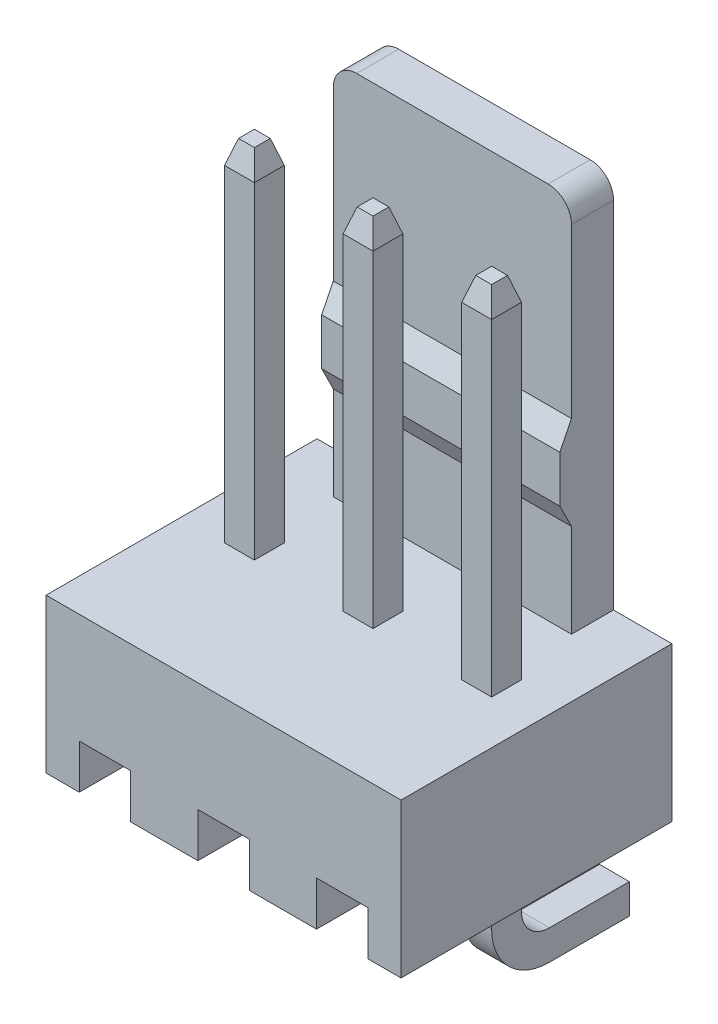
ISO-10303-21;
HEADER;
FILE_DESCRIPTION(('STEP AP214'),'2;1');
FILE_NAME('part.step','',(''),(''),'','','');
FILE_SCHEMA(('AUTOMOTIVE_DESIGN { 1 0 10303 214 1 1 1 1 }'));
ENDSEC;
DATA;
#1=APPLICATION_CONTEXT('core data for automotive mechanical design processes');
#2=APPLICATION_PROTOCOL_DEFINITION('international standard','automotive_design',2000,#1);
#3=PRODUCT_CONTEXT('',#1,'mechanical');
#4=PRODUCT('Part','Part','',(#3));
#5=PRODUCT_RELATED_PRODUCT_CATEGORY('part','',(#4));
#6=PRODUCT_DEFINITION_FORMATION('','',#4);
#7=PRODUCT_DEFINITION_CONTEXT('part definition',#1,'design');
#8=PRODUCT_DEFINITION('design','',#6,#7);
#9=PRODUCT_DEFINITION_SHAPE('','',#8);
#10=(LENGTH_UNIT() NAMED_UNIT(*) SI_UNIT(.MILLI.,.METRE.));
#11=(NAMED_UNIT(*) PLANE_ANGLE_UNIT() SI_UNIT($,.RADIAN.));
#12=(NAMED_UNIT(*) SI_UNIT($,.STERADIAN.) SOLID_ANGLE_UNIT());
#13=UNCERTAINTY_MEASURE_WITH_UNIT(LENGTH_MEASURE(1.E-05),#10,'distance_accuracy_value','');
#14=(GEOMETRIC_REPRESENTATION_CONTEXT(3) GLOBAL_UNCERTAINTY_ASSIGNED_CONTEXT((#13)) GLOBAL_UNIT_ASSIGNED_CONTEXT((#10,
#11,#12)) REPRESENTATION_CONTEXT('',''));
#15=CARTESIAN_POINT('',(0.,0.,0.));
#16=DIRECTION('',(0.,0.,1.));
#17=DIRECTION('',(1.,0.,0.));
#18=AXIS2_PLACEMENT_3D('',#15,#16,#17);
#19=CARTESIAN_POINT('',(3.8,3.3,3.2));
#20=DIRECTION('',(0.,-1.,0.));
#21=DIRECTION('',(0.,0.,-1.));
#22=AXIS2_PLACEMENT_3D('',#19,#20,#21);
#23=PLANE('',#22);
#24=DIRECTION('',(0.,0.,1.));
#25=VECTOR('',#24,1.);
#26=CARTESIAN_POINT('',(2.22,3.3,3.2));
#27=LINE('',#26,#25);
#28=CARTESIAN_POINT('',(2.22,3.3,-0.32));
#29=VERTEX_POINT('',#28);
#30=CARTESIAN_POINT('',(2.22,3.3,0.32));
#31=VERTEX_POINT('',#30);
#32=EDGE_CURVE('E643',#29,#31,#27,.T.);
#33=ORIENTED_EDGE('',*,*,#32,.F.);
#34=DIRECTION('',(-1.,0.,0.));
#35=VECTOR('',#34,1.);
#36=CARTESIAN_POINT('',(3.8,3.3,-0.32));
#37=LINE('',#36,#35);
#38=CARTESIAN_POINT('',(2.86,3.3,-0.32));
#39=VERTEX_POINT('',#38);
#40=EDGE_CURVE('E632',#39,#29,#37,.T.);
#41=ORIENTED_EDGE('',*,*,#40,.F.);
#42=DIRECTION('',(0.,0.,-1.));
#43=VECTOR('',#42,1.);
#44=CARTESIAN_POINT('',(2.86,3.3,3.2));
#45=LINE('',#44,#43);
#46=CARTESIAN_POINT('',(2.86,3.3,0.32));
#47=VERTEX_POINT('',#46);
#48=EDGE_CURVE('E637',#47,#39,#45,.T.);
#49=ORIENTED_EDGE('',*,*,#48,.F.);
#50=DIRECTION('',(1.,0.,0.));
#51=VECTOR('',#50,1.);
#52=CARTESIAN_POINT('',(3.8,3.3,0.32));
#53=LINE('',#52,#51);
#54=EDGE_CURVE('E640',#31,#47,#53,.T.);
#55=ORIENTED_EDGE('',*,*,#54,.F.);
#56=EDGE_LOOP('',(#33,#41,#49,#55));
#57=FACE_BOUND('',#56,.T.);
#58=DIRECTION('',(0.,0.,1.));
#59=VECTOR('',#58,1.);
#60=CARTESIAN_POINT('',(-3.8,3.3,3.2));
#61=LINE('',#60,#59);
#62=CARTESIAN_POINT('',(-3.8,3.3,-2.6));
#63=VERTEX_POINT('',#62);
#64=CARTESIAN_POINT('',(-3.8,3.3,3.2));
#65=VERTEX_POINT('',#64);
#66=EDGE_CURVE('E805',#63,#65,#61,.T.);
#67=ORIENTED_EDGE('',*,*,#66,.T.);
#68=DIRECTION('',(-1.,0.,0.));
#69=VECTOR('',#68,1.);
#70=CARTESIAN_POINT('',(3.8,3.3,3.2));
#71=LINE('',#70,#69);
#72=CARTESIAN_POINT('',(3.8,3.3,3.2));
#73=VERTEX_POINT('',#72);
#74=EDGE_CURVE('E812',#73,#65,#71,.T.);
#75=ORIENTED_EDGE('',*,*,#74,.F.);
#76=DIRECTION('',(0.,0.,1.));
#77=VECTOR('',#76,1.);
#78=CARTESIAN_POINT('',(3.8,3.3,3.2));
#79=LINE('',#78,#77);
#80=CARTESIAN_POINT('',(3.8,3.30000000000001,-2.6));
#81=VERTEX_POINT('',#80);
#82=EDGE_CURVE('E810',#81,#73,#79,.T.);
#83=ORIENTED_EDGE('',*,*,#82,.F.);
#84=DIRECTION('',(-1.,0.,0.));
#85=VECTOR('',#84,1.);
#86=CARTESIAN_POINT('',(2.55,3.30000000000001,-2.6));
#87=LINE('',#86,#85);
#88=CARTESIAN_POINT('',(2.55,3.30000000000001,-2.6));
#89=VERTEX_POINT('',#88);
#90=EDGE_CURVE('E749',#81,#89,#87,.T.);
#91=ORIENTED_EDGE('',*,*,#90,.T.);
#92=DIRECTION('',(0.,0.,-1.));
#93=VECTOR('',#92,1.);
#94=CARTESIAN_POINT('',(2.55,3.30000000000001,3.2));
#95=LINE('',#94,#93);
#96=CARTESIAN_POINT('',(2.55,3.30000000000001,-1.7));
#97=VERTEX_POINT('',#96);
#98=EDGE_CURVE('E761',#97,#89,#95,.T.);
#99=ORIENTED_EDGE('',*,*,#98,.F.);
#100=DIRECTION('',(-1.,0.,0.));
#101=VECTOR('',#100,1.);
#102=CARTESIAN_POINT('',(3.8,3.3,-1.7));
#103=LINE('',#102,#101);
#104=CARTESIAN_POINT('',(-2.55,3.3,-1.7));
#105=VERTEX_POINT('',#104);
#106=EDGE_CURVE('E824',#97,#105,#103,.T.);
#107=ORIENTED_EDGE('',*,*,#106,.T.);
#108=DIRECTION('',(0.,0.,-1.));
#109=VECTOR('',#108,1.);
#110=CARTESIAN_POINT('',(-2.55,3.3,3.2));
#111=LINE('',#110,#109);
#112=CARTESIAN_POINT('',(-2.55,3.3,-2.6));
#113=VERTEX_POINT('',#112);
#114=EDGE_CURVE('E783',#105,#113,#111,.T.);
#115=ORIENTED_EDGE('',*,*,#114,.T.);
#116=DIRECTION('',(-1.,0.,0.));
#117=VECTOR('',#116,1.);
#118=CARTESIAN_POINT('',(-2.55,3.3,-2.6));
#119=LINE('',#118,#117);
#120=EDGE_CURVE('E780',#113,#63,#119,.T.);
#121=ORIENTED_EDGE('',*,*,#120,.T.);
#122=EDGE_LOOP('',(#67,#75,#83,#91,#99,#107,#115,#121));
#123=FACE_BOUND('',#122,.T.);
#124=DIRECTION('',(0.,0.,-1.));
#125=VECTOR('',#124,1.);
#126=CARTESIAN_POINT('',(0.32,3.3,3.2));
#127=LINE('',#126,#125);
#128=CARTESIAN_POINT('',(0.32,3.3,0.32));
#129=VERTEX_POINT('',#128);
#130=CARTESIAN_POINT('',(0.32,3.3,-0.32));
#131=VERTEX_POINT('',#130);
#132=EDGE_CURVE('E673',#129,#131,#127,.T.);
#133=ORIENTED_EDGE('',*,*,#132,.F.);
#134=DIRECTION('',(1.,0.,0.));
#135=VECTOR('',#134,1.);
#136=CARTESIAN_POINT('',(3.8,3.3,0.32));
#137=LINE('',#136,#135);
#138=CARTESIAN_POINT('',(-0.320000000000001,3.3,0.32));
#139=VERTEX_POINT('',#138);
#140=EDGE_CURVE('E662',#139,#129,#137,.T.);
#141=ORIENTED_EDGE('',*,*,#140,.F.);
#142=DIRECTION('',(0.,0.,1.));
#143=VECTOR('',#142,1.);
#144=CARTESIAN_POINT('',(-0.32,3.3,3.2));
#145=LINE('',#144,#143);
#146=CARTESIAN_POINT('',(-0.32,3.3,-0.32));
#147=VERTEX_POINT('',#146);
#148=EDGE_CURVE('E667',#147,#139,#145,.T.);
#149=ORIENTED_EDGE('',*,*,#148,.F.);
#150=DIRECTION('',(-1.,0.,0.));
#151=VECTOR('',#150,1.);
#152=CARTESIAN_POINT('',(3.8,3.3,-0.32));
#153=LINE('',#152,#151);
#154=EDGE_CURVE('E670',#131,#147,#153,.T.);
#155=ORIENTED_EDGE('',*,*,#154,.F.);
#156=EDGE_LOOP('',(#133,#141,#149,#155));
#157=FACE_BOUND('',#156,.T.);
#158=DIRECTION('',(0.,0.,-1.));
#159=VECTOR('',#158,1.);
#160=CARTESIAN_POINT('',(-2.22,3.3,3.2));
#161=LINE('',#160,#159);
#162=CARTESIAN_POINT('',(-2.22,3.3,0.32));
#163=VERTEX_POINT('',#162);
#164=CARTESIAN_POINT('',(-2.22,3.3,-0.32));
#165=VERTEX_POINT('',#164);
#166=EDGE_CURVE('E613',#163,#165,#161,.T.);
#167=ORIENTED_EDGE('',*,*,#166,.F.);
#168=DIRECTION('',(1.,0.,0.));
#169=VECTOR('',#168,1.);
#170=CARTESIAN_POINT('',(3.8,3.3,0.319999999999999));
#171=LINE('',#170,#169);
#172=CARTESIAN_POINT('',(-2.86,3.3,0.32));
#173=VERTEX_POINT('',#172);
#174=EDGE_CURVE('E602',#173,#163,#171,.T.);
#175=ORIENTED_EDGE('',*,*,#174,.F.);
#176=DIRECTION('',(0.,0.,1.));
#177=VECTOR('',#176,1.);
#178=CARTESIAN_POINT('',(-2.86,3.3,3.2));
#179=LINE('',#178,#177);
#180=CARTESIAN_POINT('',(-2.86,3.3,-0.32));
#181=VERTEX_POINT('',#180);
#182=EDGE_CURVE('E607',#181,#173,#179,.T.);
#183=ORIENTED_EDGE('',*,*,#182,.F.);
#184=DIRECTION('',(-1.,0.,0.));
#185=VECTOR('',#184,1.);
#186=CARTESIAN_POINT('',(3.8,3.3,-0.32));
#187=LINE('',#186,#185);
#188=EDGE_CURVE('E610',#165,#181,#187,.T.);
#189=ORIENTED_EDGE('',*,*,#188,.F.);
#190=EDGE_LOOP('',(#167,#175,#183,#189));
#191=FACE_BOUND('',#190,.T.);
#192=ADVANCED_FACE('F36',(#57,#123,#157,#191),#23,.F.);
#193=CARTESIAN_POINT('',(-1.99,0.95,3.2));
#194=DIRECTION('',(0.,1.,0.));
#195=DIRECTION('',(-1.,0.,0.));
#196=AXIS2_PLACEMENT_3D('',#193,#194,#195);
#197=PLANE('',#196);
#198=DIRECTION('',(1.,0.,0.));
#199=VECTOR('',#198,1.);
#200=CARTESIAN_POINT('',(-1.99,0.95,-2.6));
#201=LINE('',#200,#199);
#202=CARTESIAN_POINT('',(-3.09,0.95,-2.6));
#203=VERTEX_POINT('',#202);
#204=CARTESIAN_POINT('',(-1.99,0.95,-2.6));
#205=VERTEX_POINT('',#204);
#206=EDGE_CURVE('E681',#203,#205,#201,.T.);
#207=ORIENTED_EDGE('',*,*,#206,.T.);
#208=DIRECTION('',(0.,0.,-1.));
#209=VECTOR('',#208,1.);
#210=CARTESIAN_POINT('',(-1.99,0.95,3.2));
#211=LINE('',#210,#209);
#212=CARTESIAN_POINT('',(-1.99,0.95,3.2));
#213=VERTEX_POINT('',#212);
#214=EDGE_CURVE('E694',#213,#205,#211,.T.);
#215=ORIENTED_EDGE('',*,*,#214,.F.);
#216=DIRECTION('',(1.,0.,0.));
#217=VECTOR('',#216,1.);
#218=CARTESIAN_POINT('',(-1.99,0.95,3.2));
#219=LINE('',#218,#217);
#220=CARTESIAN_POINT('',(-3.09,0.95,3.2));
#221=VERTEX_POINT('',#220);
#222=EDGE_CURVE('E684',#221,#213,#219,.T.);
#223=ORIENTED_EDGE('',*,*,#222,.F.);
#224=DIRECTION('',(0.,0.,-1.));
#225=VECTOR('',#224,1.);
#226=CARTESIAN_POINT('',(-3.09,0.95,3.2));
#227=LINE('',#226,#225);
#228=EDGE_CURVE('E697',#221,#203,#227,.T.);
#229=ORIENTED_EDGE('',*,*,#228,.T.);
#230=EDGE_LOOP('',(#207,#215,#223,#229));
#231=FACE_BOUND('',#230,.T.);
#232=DIRECTION('',(0.,0.,1.));
#233=VECTOR('',#232,1.);
#234=CARTESIAN_POINT('',(-2.22,0.95,3.2));
#235=LINE('',#234,#233);
#236=CARTESIAN_POINT('',(-2.22,0.95,-0.32));
#237=VERTEX_POINT('',#236);
#238=CARTESIAN_POINT('',(-2.22,0.95,0.32));
#239=VERTEX_POINT('',#238);
#240=EDGE_CURVE('E904',#237,#239,#235,.T.);
#241=ORIENTED_EDGE('',*,*,#240,.F.);
#242=DIRECTION('',(1.,0.,0.));
#243=VECTOR('',#242,1.);
#244=CARTESIAN_POINT('',(-1.99,0.95,-0.32));
#245=LINE('',#244,#243);
#246=CARTESIAN_POINT('',(-2.86,0.95,-0.32));
#247=VERTEX_POINT('',#246);
#248=EDGE_CURVE('E901',#247,#237,#245,.T.);
#249=ORIENTED_EDGE('',*,*,#248,.F.);
#250=DIRECTION('',(0.,0.,-1.));
#251=VECTOR('',#250,1.);
#252=CARTESIAN_POINT('',(-2.86,0.95,3.2));
#253=LINE('',#252,#251);
#254=CARTESIAN_POINT('',(-2.86,0.95,0.32));
#255=VERTEX_POINT('',#254);
#256=EDGE_CURVE('E898',#255,#247,#253,.T.);
#257=ORIENTED_EDGE('',*,*,#256,.F.);
#258=DIRECTION('',(-1.,0.,0.));
#259=VECTOR('',#258,1.);
#260=CARTESIAN_POINT('',(-1.99,0.95,0.32));
#261=LINE('',#260,#259);
#262=EDGE_CURVE('E895',#239,#255,#261,.T.);
#263=ORIENTED_EDGE('',*,*,#262,.F.);
#264=EDGE_LOOP('',(#241,#249,#257,#263));
#265=FACE_BOUND('',#264,.T.);
#266=ADVANCED_FACE('F1022',(#231,#265),#197,.F.);
#267=CARTESIAN_POINT('',(1.99,0.950000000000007,3.2));
#268=DIRECTION('',(0.,1.,0.));
#269=DIRECTION('',(-1.,0.,0.));
#270=AXIS2_PLACEMENT_3D('',#267,#268,#269);
#271=PLANE('',#270);
#272=DIRECTION('',(1.,0.,0.));
#273=VECTOR('',#272,1.);
#274=CARTESIAN_POINT('',(1.99,0.950000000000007,-2.6));
#275=LINE('',#274,#273);
#276=CARTESIAN_POINT('',(1.99,0.950000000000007,-2.6));
#277=VERTEX_POINT('',#276);
#278=CARTESIAN_POINT('',(3.09,0.950000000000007,-2.6));
#279=VERTEX_POINT('',#278);
#280=EDGE_CURVE('E715',#277,#279,#275,.T.);
#281=ORIENTED_EDGE('',*,*,#280,.T.);
#282=DIRECTION('',(0.,0.,-1.));
#283=VECTOR('',#282,1.);
#284=CARTESIAN_POINT('',(3.09,0.950000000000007,3.2));
#285=LINE('',#284,#283);
#286=CARTESIAN_POINT('',(3.09,0.950000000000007,3.2));
#287=VERTEX_POINT('',#286);
#288=EDGE_CURVE('E725',#287,#279,#285,.T.);
#289=ORIENTED_EDGE('',*,*,#288,.F.);
#290=DIRECTION('',(1.,0.,0.));
#291=VECTOR('',#290,1.);
#292=CARTESIAN_POINT('',(1.99,0.950000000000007,3.2));
#293=LINE('',#292,#291);
#294=CARTESIAN_POINT('',(1.99,0.950000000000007,3.2));
#295=VERTEX_POINT('',#294);
#296=EDGE_CURVE('E706',#295,#287,#293,.T.);
#297=ORIENTED_EDGE('',*,*,#296,.F.);
#298=DIRECTION('',(0.,0.,-1.));
#299=VECTOR('',#298,1.);
#300=CARTESIAN_POINT('',(1.99,0.950000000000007,3.2));
#301=LINE('',#300,#299);
#302=EDGE_CURVE('E713',#295,#277,#301,.T.);
#303=ORIENTED_EDGE('',*,*,#302,.T.);
#304=EDGE_LOOP('',(#281,#289,#297,#303));
#305=FACE_BOUND('',#304,.T.);
#306=DIRECTION('',(0.,0.,-1.));
#307=VECTOR('',#306,1.);
#308=CARTESIAN_POINT('',(2.22,0.950000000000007,3.2));
#309=LINE('',#308,#307);
#310=CARTESIAN_POINT('',(2.22,0.950000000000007,0.32));
#311=VERTEX_POINT('',#310);
#312=CARTESIAN_POINT('',(2.22,0.950000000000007,-0.32));
#313=VERTEX_POINT('',#312);
#314=EDGE_CURVE('E892',#311,#313,#309,.T.);
#315=ORIENTED_EDGE('',*,*,#314,.F.);
#316=DIRECTION('',(-1.,0.,0.));
#317=VECTOR('',#316,1.);
#318=CARTESIAN_POINT('',(1.99,0.950000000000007,0.32));
#319=LINE('',#318,#317);
#320=CARTESIAN_POINT('',(2.86,0.950000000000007,0.32));
#321=VERTEX_POINT('',#320);
#322=EDGE_CURVE('E889',#321,#311,#319,.T.);
#323=ORIENTED_EDGE('',*,*,#322,.F.);
#324=DIRECTION('',(0.,0.,1.));
#325=VECTOR('',#324,1.);
#326=CARTESIAN_POINT('',(2.86,0.950000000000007,3.2));
#327=LINE('',#326,#325);
#328=CARTESIAN_POINT('',(2.86,0.950000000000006,-0.32));
#329=VERTEX_POINT('',#328);
#330=EDGE_CURVE('E886',#329,#321,#327,.T.);
#331=ORIENTED_EDGE('',*,*,#330,.F.);
#332=DIRECTION('',(1.,0.,0.));
#333=VECTOR('',#332,1.);
#334=CARTESIAN_POINT('',(1.99,0.950000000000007,-0.32));
#335=LINE('',#334,#333);
#336=EDGE_CURVE('E883',#313,#329,#335,.T.);
#337=ORIENTED_EDGE('',*,*,#336,.F.);
#338=EDGE_LOOP('',(#315,#323,#331,#337));
#339=FACE_BOUND('',#338,.T.);
#340=ADVANCED_FACE('F1028',(#305,#339),#271,.F.);
#341=CARTESIAN_POINT('',(0.549999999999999,0.95,3.2));
#342=DIRECTION('',(0.,1.,0.));
#343=DIRECTION('',(-1.,0.,0.));
#344=AXIS2_PLACEMENT_3D('',#341,#342,#343);
#345=PLANE('',#344);
#346=DIRECTION('',(1.,0.,0.));
#347=VECTOR('',#346,1.);
#348=CARTESIAN_POINT('',(0.549999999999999,0.95,-2.6));
#349=LINE('',#348,#347);
#350=CARTESIAN_POINT('',(-0.550000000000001,0.95,-2.6));
#351=VERTEX_POINT('',#350);
#352=CARTESIAN_POINT('',(0.549999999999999,0.95,-2.6));
#353=VERTEX_POINT('',#352);
#354=EDGE_CURVE('E733',#351,#353,#349,.T.);
#355=ORIENTED_EDGE('',*,*,#354,.T.);
#356=DIRECTION('',(0.,0.,-1.));
#357=VECTOR('',#356,1.);
#358=CARTESIAN_POINT('',(0.549999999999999,0.95,3.2));
#359=LINE('',#358,#357);
#360=CARTESIAN_POINT('',(0.549999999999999,0.95,3.2));
#361=VERTEX_POINT('',#360);
#362=EDGE_CURVE('E747',#361,#353,#359,.T.);
#363=ORIENTED_EDGE('',*,*,#362,.F.);
#364=DIRECTION('',(1.,0.,0.));
#365=VECTOR('',#364,1.);
#366=CARTESIAN_POINT('',(0.549999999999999,0.95,3.2));
#367=LINE('',#366,#365);
#368=CARTESIAN_POINT('',(-0.550000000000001,0.95,3.2));
#369=VERTEX_POINT('',#368);
#370=EDGE_CURVE('E736',#369,#361,#367,.T.);
#371=ORIENTED_EDGE('',*,*,#370,.F.);
#372=DIRECTION('',(0.,0.,-1.));
#373=VECTOR('',#372,1.);
#374=CARTESIAN_POINT('',(-0.550000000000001,0.95,3.2));
#375=LINE('',#374,#373);
#376=EDGE_CURVE('E750',#369,#351,#375,.T.);
#377=ORIENTED_EDGE('',*,*,#376,.T.);
#378=EDGE_LOOP('',(#355,#363,#371,#377));
#379=FACE_BOUND('',#378,.T.);
#380=DIRECTION('',(0.,0.,1.));
#381=VECTOR('',#380,1.);
#382=CARTESIAN_POINT('',(0.32,0.95,3.2));
#383=LINE('',#382,#381);
#384=CARTESIAN_POINT('',(0.319999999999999,0.95,-0.32));
#385=VERTEX_POINT('',#384);
#386=CARTESIAN_POINT('',(0.32,0.95,0.32));
#387=VERTEX_POINT('',#386);
#388=EDGE_CURVE('E880',#385,#387,#383,.T.);
#389=ORIENTED_EDGE('',*,*,#388,.F.);
#390=DIRECTION('',(1.,0.,0.));
#391=VECTOR('',#390,1.);
#392=CARTESIAN_POINT('',(0.549999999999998,0.95,-0.32));
#393=LINE('',#392,#391);
#394=CARTESIAN_POINT('',(-0.32,0.95,-0.32));
#395=VERTEX_POINT('',#394);
#396=EDGE_CURVE('E877',#395,#385,#393,.T.);
#397=ORIENTED_EDGE('',*,*,#396,.F.);
#398=DIRECTION('',(0.,0.,-1.));
#399=VECTOR('',#398,1.);
#400=CARTESIAN_POINT('',(-0.32,0.95,3.2));
#401=LINE('',#400,#399);
#402=CARTESIAN_POINT('',(-0.32,0.95,0.32));
#403=VERTEX_POINT('',#402);
#404=EDGE_CURVE('E874',#403,#395,#401,.T.);
#405=ORIENTED_EDGE('',*,*,#404,.F.);
#406=DIRECTION('',(-1.,0.,0.));
#407=VECTOR('',#406,1.);
#408=CARTESIAN_POINT('',(0.549999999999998,0.95,0.32));
#409=LINE('',#408,#407);
#410=EDGE_CURVE('E871',#387,#403,#409,.T.);
#411=ORIENTED_EDGE('',*,*,#410,.F.);
#412=EDGE_LOOP('',(#389,#397,#405,#411));
#413=FACE_BOUND('',#412,.T.);
#414=ADVANCED_FACE('F1589',(#379,#413),#345,.F.);
#415=CARTESIAN_POINT('',(3.8,0.,3.2));
#416=DIRECTION('',(0.,1.,0.));
#417=DIRECTION('',(0.,0.,1.));
#418=AXIS2_PLACEMENT_3D('',#415,#416,#417);
#419=PLANE('',#418);
#420=DIRECTION('',(-1.,0.,0.));
#421=VECTOR('',#420,1.);
#422=CARTESIAN_POINT('',(3.8,0.,3.2));
#423=LINE('',#422,#421);
#424=CARTESIAN_POINT('',(-0.550000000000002,0.,3.2));
#425=VERTEX_POINT('',#424);
#426=CARTESIAN_POINT('',(-1.99,0.,3.2));
#427=VERTEX_POINT('',#426);
#428=EDGE_CURVE('E853',#425,#427,#423,.T.);
#429=ORIENTED_EDGE('',*,*,#428,.T.);
#430=DIRECTION('',(0.,0.,-1.));
#431=VECTOR('',#430,1.);
#432=CARTESIAN_POINT('',(-1.99,0.,3.2));
#433=LINE('',#432,#431);
#434=CARTESIAN_POINT('',(-1.99,0.,-2.6));
#435=VERTEX_POINT('',#434);
#436=EDGE_CURVE('E687',#427,#435,#433,.T.);
#437=ORIENTED_EDGE('',*,*,#436,.T.);
#438=DIRECTION('',(-1.,0.,0.));
#439=VECTOR('',#438,1.);
#440=CARTESIAN_POINT('',(3.8,0.,-2.6));
#441=LINE('',#440,#439);
#442=CARTESIAN_POINT('',(-0.55,0.,-2.6));
#443=VERTEX_POINT('',#442);
#444=EDGE_CURVE('E847',#443,#435,#441,.T.);
#445=ORIENTED_EDGE('',*,*,#444,.F.);
#446=DIRECTION('',(0.,0.,-1.));
#447=VECTOR('',#446,1.);
#448=CARTESIAN_POINT('',(-0.550000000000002,0.,3.2));
#449=LINE('',#448,#447);
#450=EDGE_CURVE('E752',#425,#443,#449,.T.);
#451=ORIENTED_EDGE('',*,*,#450,.F.);
#452=EDGE_LOOP('',(#429,#437,#445,#451));
#453=FACE_BOUND('',#452,.T.);
#454=ADVANCED_FACE('F1071',(#453),#419,.F.);
#455=CARTESIAN_POINT('',(1.99,0.,-2.6));
#456=VERTEX_POINT('',#455);
#457=CARTESIAN_POINT('',(0.549999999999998,0.,-2.6));
#458=VERTEX_POINT('',#457);
#459=EDGE_CURVE('E846',#456,#458,#441,.T.);
#460=ORIENTED_EDGE('',*,*,#459,.F.);
#461=DIRECTION('',(0.,0.,-1.));
#462=VECTOR('',#461,1.);
#463=CARTESIAN_POINT('',(1.99,0.,3.2));
#464=LINE('',#463,#462);
#465=CARTESIAN_POINT('',(1.99,0.,3.2));
#466=VERTEX_POINT('',#465);
#467=EDGE_CURVE('E719',#466,#456,#464,.T.);
#468=ORIENTED_EDGE('',*,*,#467,.F.);
#469=CARTESIAN_POINT('',(0.549999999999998,0.,3.2));
#470=VERTEX_POINT('',#469);
#471=EDGE_CURVE('E852',#466,#470,#423,.T.);
#472=ORIENTED_EDGE('',*,*,#471,.T.);
#473=DIRECTION('',(0.,0.,-1.));
#474=VECTOR('',#473,1.);
#475=CARTESIAN_POINT('',(0.549999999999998,0.,3.2));
#476=LINE('',#475,#474);
#477=EDGE_CURVE('E739',#470,#458,#476,.T.);
#478=ORIENTED_EDGE('',*,*,#477,.T.);
#479=EDGE_LOOP('',(#460,#468,#472,#478));
#480=FACE_BOUND('',#479,.T.);
#481=ADVANCED_FACE('F1786',(#480),#419,.F.);
#482=CARTESIAN_POINT('',(3.8,0.,3.2));
#483=VERTEX_POINT('',#482);
#484=CARTESIAN_POINT('',(3.09,0.,3.2));
#485=VERTEX_POINT('',#484);
#486=EDGE_CURVE('E848',#483,#485,#423,.T.);
#487=ORIENTED_EDGE('',*,*,#486,.T.);
#488=DIRECTION('',(0.,0.,-1.));
#489=VECTOR('',#488,1.);
#490=CARTESIAN_POINT('',(3.09,0.,3.2));
#491=LINE('',#490,#489);
#492=CARTESIAN_POINT('',(3.09,0.,-2.6));
#493=VERTEX_POINT('',#492);
#494=EDGE_CURVE('E722',#485,#493,#491,.T.);
#495=ORIENTED_EDGE('',*,*,#494,.T.);
#496=CARTESIAN_POINT('',(3.8,0.,-2.6));
#497=VERTEX_POINT('',#496);
#498=EDGE_CURVE('E842',#497,#493,#441,.T.);
#499=ORIENTED_EDGE('',*,*,#498,.F.);
#500=DIRECTION('',(0.,0.,-1.));
#501=VECTOR('',#500,1.);
#502=CARTESIAN_POINT('',(3.8,0.,3.2));
#503=LINE('',#502,#501);
#504=EDGE_CURVE('E804',#483,#497,#503,.T.);
#505=ORIENTED_EDGE('',*,*,#504,.F.);
#506=EDGE_LOOP('',(#487,#495,#499,#505));
#507=FACE_BOUND('',#506,.T.);
#508=ADVANCED_FACE('F1072',(#507),#419,.F.);
#509=CARTESIAN_POINT('',(3.8,0.,3.2));
#510=DIRECTION('',(0.,0.,-1.));
#511=DIRECTION('',(-1.,0.,0.));
#512=AXIS2_PLACEMENT_3D('',#509,#510,#511);
#513=PLANE('',#512);
#514=ORIENTED_EDGE('',*,*,#222,.T.);
#515=DIRECTION('',(0.,-1.,0.));
#516=VECTOR('',#515,1.);
#517=CARTESIAN_POINT('',(-1.99,0.95,3.2));
#518=LINE('',#517,#516);
#519=EDGE_CURVE('E677',#213,#427,#518,.T.);
#520=ORIENTED_EDGE('',*,*,#519,.T.);
#521=ORIENTED_EDGE('',*,*,#428,.F.);
#522=DIRECTION('',(0.,1.,0.));
#523=VECTOR('',#522,1.);
#524=CARTESIAN_POINT('',(-0.550000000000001,0.95,3.2));
#525=LINE('',#524,#523);
#526=EDGE_CURVE('E732',#425,#369,#525,.T.);
#527=ORIENTED_EDGE('',*,*,#526,.T.);
#528=ORIENTED_EDGE('',*,*,#370,.T.);
#529=DIRECTION('',(0.,-1.,0.));
#530=VECTOR('',#529,1.);
#531=CARTESIAN_POINT('',(0.549999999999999,0.95,3.2));
#532=LINE('',#531,#530);
#533=EDGE_CURVE('E729',#361,#470,#532,.T.);
#534=ORIENTED_EDGE('',*,*,#533,.T.);
#535=ORIENTED_EDGE('',*,*,#471,.F.);
#536=DIRECTION('',(0.,1.,0.));
#537=VECTOR('',#536,1.);
#538=CARTESIAN_POINT('',(1.99,0.950000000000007,3.2));
#539=LINE('',#538,#537);
#540=EDGE_CURVE('E703',#466,#295,#539,.T.);
#541=ORIENTED_EDGE('',*,*,#540,.T.);
#542=ORIENTED_EDGE('',*,*,#296,.T.);
#543=DIRECTION('',(0.,-1.,0.));
#544=VECTOR('',#543,1.);
#545=CARTESIAN_POINT('',(3.09,0.950000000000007,3.2));
#546=LINE('',#545,#544);
#547=EDGE_CURVE('E710',#287,#485,#546,.T.);
#548=ORIENTED_EDGE('',*,*,#547,.T.);
#549=ORIENTED_EDGE('',*,*,#486,.F.);
#550=DIRECTION('',(0.,-1.,0.));
#551=VECTOR('',#550,1.);
#552=CARTESIAN_POINT('',(3.8,0.,3.2));
#553=LINE('',#552,#551);
#554=EDGE_CURVE('E801',#73,#483,#553,.T.);
#555=ORIENTED_EDGE('',*,*,#554,.F.);
#556=ORIENTED_EDGE('',*,*,#74,.T.);
#557=DIRECTION('',(0.,-1.,0.));
#558=VECTOR('',#557,1.);
#559=CARTESIAN_POINT('',(-3.8,0.,3.2));
#560=LINE('',#559,#558);
#561=CARTESIAN_POINT('',(-3.8,0.,3.2));
#562=VERTEX_POINT('',#561);
#563=EDGE_CURVE('E800',#65,#562,#560,.T.);
#564=ORIENTED_EDGE('',*,*,#563,.T.);
#565=CARTESIAN_POINT('',(-3.09,0.,3.2));
#566=VERTEX_POINT('',#565);
#567=EDGE_CURVE('E845',#566,#562,#423,.T.);
#568=ORIENTED_EDGE('',*,*,#567,.F.);
#569=DIRECTION('',(0.,1.,0.));
#570=VECTOR('',#569,1.);
#571=CARTESIAN_POINT('',(-3.09,0.95,3.2));
#572=LINE('',#571,#570);
#573=EDGE_CURVE('E680',#566,#221,#572,.T.);
#574=ORIENTED_EDGE('',*,*,#573,.T.);
#575=EDGE_LOOP('',(#514,#520,#521,#527,#528,#534,#535,#541,#542,#548,#549,#555,#556,#564,#568,#574));
#576=FACE_BOUND('',#575,.T.);
#577=ADVANCED_FACE('F1069',(#576),#513,.F.);
#578=CARTESIAN_POINT('',(-3.09,0.,-2.6));
#579=VERTEX_POINT('',#578);
#580=CARTESIAN_POINT('',(-3.8,0.,-2.6));
#581=VERTEX_POINT('',#580);
#582=EDGE_CURVE('E841',#579,#581,#441,.T.);
#583=ORIENTED_EDGE('',*,*,#582,.F.);
#584=DIRECTION('',(0.,0.,-1.));
#585=VECTOR('',#584,1.);
#586=CARTESIAN_POINT('',(-3.09,0.,3.2));
#587=LINE('',#586,#585);
#588=EDGE_CURVE('E699',#566,#579,#587,.T.);
#589=ORIENTED_EDGE('',*,*,#588,.F.);
#590=ORIENTED_EDGE('',*,*,#567,.T.);
#591=DIRECTION('',(0.,0.,-1.));
#592=VECTOR('',#591,1.);
#593=CARTESIAN_POINT('',(-3.8,0.,3.2));
#594=LINE('',#593,#592);
#595=EDGE_CURVE('E815',#562,#581,#594,.T.);
#596=ORIENTED_EDGE('',*,*,#595,.T.);
#597=EDGE_LOOP('',(#583,#589,#590,#596));
#598=FACE_BOUND('',#597,.T.);
#599=ADVANCED_FACE('F1065',(#598),#419,.F.);
#600=CARTESIAN_POINT('',(3.8,0.,-2.6));
#601=DIRECTION('',(0.,0.,1.));
#602=DIRECTION('',(0.,-1.,0.));
#603=AXIS2_PLACEMENT_3D('',#600,#601,#602);
#604=PLANE('',#603);
#605=DIRECTION('',(0.,-1.,0.));
#606=VECTOR('',#605,1.);
#607=CARTESIAN_POINT('',(-2.55,12.4,-2.6));
#608=LINE('',#607,#606);
#609=CARTESIAN_POINT('',(-2.55,10.9,-2.6));
#610=VERTEX_POINT('',#609);
#611=EDGE_CURVE('E778',#610,#113,#608,.T.);
#612=ORIENTED_EDGE('',*,*,#611,.F.);
#613=CARTESIAN_POINT('',(-2.05,10.9,-2.6));
#614=DIRECTION('',(0.,0.,1.));
#615=DIRECTION('',(0.,-1.,0.));
#616=AXIS2_PLACEMENT_3D('',#613,#614,#615);
#617=CIRCLE('',#616,0.5);
#618=CARTESIAN_POINT('',(-2.05,11.4,-2.6));
#619=VERTEX_POINT('',#618);
#620=EDGE_CURVE('E867',#610,#619,#617,.F.);
#621=ORIENTED_EDGE('',*,*,#620,.T.);
#622=DIRECTION('',(-1.,0.,0.));
#623=VECTOR('',#622,1.);
#624=CARTESIAN_POINT('',(3.8,11.4,-2.6));
#625=LINE('',#624,#623);
#626=CARTESIAN_POINT('',(2.05,11.4,-2.6));
#627=VERTEX_POINT('',#626);
#628=EDGE_CURVE('E838',#627,#619,#625,.T.);
#629=ORIENTED_EDGE('',*,*,#628,.F.);
#630=CARTESIAN_POINT('',(2.05,10.9,-2.6));
#631=DIRECTION('',(0.,0.,1.));
#632=DIRECTION('',(0.,-1.,0.));
#633=AXIS2_PLACEMENT_3D('',#630,#631,#632);
#634=CIRCLE('',#633,0.5);
#635=CARTESIAN_POINT('',(2.55,10.9,-2.6));
#636=VERTEX_POINT('',#635);
#637=EDGE_CURVE('E865',#627,#636,#634,.F.);
#638=ORIENTED_EDGE('',*,*,#637,.T.);
#639=DIRECTION('',(0.,1.,0.));
#640=VECTOR('',#639,1.);
#641=CARTESIAN_POINT('',(2.55,12.4,-2.6));
#642=LINE('',#641,#640);
#643=EDGE_CURVE('E758',#89,#636,#642,.T.);
#644=ORIENTED_EDGE('',*,*,#643,.F.);
#645=ORIENTED_EDGE('',*,*,#90,.F.);
#646=DIRECTION('',(0.,1.,0.));
#647=VECTOR('',#646,1.);
#648=CARTESIAN_POINT('',(3.8,0.,-2.6));
#649=LINE('',#648,#647);
#650=EDGE_CURVE('E807',#497,#81,#649,.T.);
#651=ORIENTED_EDGE('',*,*,#650,.F.);
#652=ORIENTED_EDGE('',*,*,#498,.T.);
#653=DIRECTION('',(0.,-1.,0.));
#654=VECTOR('',#653,1.);
#655=CARTESIAN_POINT('',(3.09,0.950000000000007,-2.6));
#656=LINE('',#655,#654);
#657=EDGE_CURVE('E707',#279,#493,#656,.T.);
#658=ORIENTED_EDGE('',*,*,#657,.F.);
#659=ORIENTED_EDGE('',*,*,#280,.F.);
#660=DIRECTION('',(0.,1.,0.));
#661=VECTOR('',#660,1.);
#662=CARTESIAN_POINT('',(1.99,0.950000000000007,-2.6));
#663=LINE('',#662,#661);
#664=EDGE_CURVE('E696',#456,#277,#663,.T.);
#665=ORIENTED_EDGE('',*,*,#664,.F.);
#666=ORIENTED_EDGE('',*,*,#459,.T.);
#667=DIRECTION('',(0.,-1.,0.));
#668=VECTOR('',#667,1.);
#669=CARTESIAN_POINT('',(0.549999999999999,0.95,-2.6));
#670=LINE('',#669,#668);
#671=EDGE_CURVE('E721',#353,#458,#670,.T.);
#672=ORIENTED_EDGE('',*,*,#671,.F.);
#673=ORIENTED_EDGE('',*,*,#354,.F.);
#674=DIRECTION('',(0.,1.,0.));
#675=VECTOR('',#674,1.);
#676=CARTESIAN_POINT('',(-0.550000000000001,0.95,-2.6));
#677=LINE('',#676,#675);
#678=EDGE_CURVE('E742',#443,#351,#677,.T.);
#679=ORIENTED_EDGE('',*,*,#678,.F.);
#680=ORIENTED_EDGE('',*,*,#444,.T.);
#681=DIRECTION('',(0.,-1.,0.));
#682=VECTOR('',#681,1.);
#683=CARTESIAN_POINT('',(-1.99,0.95,-2.6));
#684=LINE('',#683,#682);
#685=EDGE_CURVE('E676',#205,#435,#684,.T.);
#686=ORIENTED_EDGE('',*,*,#685,.F.);
#687=ORIENTED_EDGE('',*,*,#206,.F.);
#688=DIRECTION('',(0.,1.,0.));
#689=VECTOR('',#688,1.);
#690=CARTESIAN_POINT('',(-3.09,0.95,-2.6));
#691=LINE('',#690,#689);
#692=EDGE_CURVE('E689',#579,#203,#691,.T.);
#693=ORIENTED_EDGE('',*,*,#692,.F.);
#694=ORIENTED_EDGE('',*,*,#582,.T.);
#695=DIRECTION('',(0.,1.,0.));
#696=VECTOR('',#695,1.);
#697=CARTESIAN_POINT('',(-3.8,0.,-2.6));
#698=LINE('',#697,#696);
#699=EDGE_CURVE('E818',#581,#63,#698,.T.);
#700=ORIENTED_EDGE('',*,*,#699,.T.);
#701=ORIENTED_EDGE('',*,*,#120,.F.);
#702=EDGE_LOOP('',(#612,#621,#629,#638,#644,#645,#651,#652,#658,#659,#665,#666,#672,#673,#679,
#680,#686,#687,#693,#694,#700,#701));
#703=FACE_BOUND('',#702,.T.);
#704=ADVANCED_FACE('F1061',(#703),#604,.F.);
#705=CARTESIAN_POINT('',(3.8,11.4,-2.6));
#706=DIRECTION('',(0.,-1.,0.));
#707=DIRECTION('',(0.,0.,-1.));
#708=AXIS2_PLACEMENT_3D('',#705,#706,#707);
#709=PLANE('',#708);
#710=ORIENTED_EDGE('',*,*,#628,.T.);
#711=DIRECTION('',(0.,0.,1.));
#712=VECTOR('',#711,1.);
#713=CARTESIAN_POINT('',(-2.05,11.4,-2.6));
#714=LINE('',#713,#712);
#715=CARTESIAN_POINT('',(-2.05,11.4,-1.7));
#716=VERTEX_POINT('',#715);
#717=EDGE_CURVE('E856',#619,#716,#714,.T.);
#718=ORIENTED_EDGE('',*,*,#717,.T.);
#719=DIRECTION('',(-1.,0.,0.));
#720=VECTOR('',#719,1.);
#721=CARTESIAN_POINT('',(3.8,11.4,-1.7));
#722=LINE('',#721,#720);
#723=CARTESIAN_POINT('',(2.05,11.4,-1.7));
#724=VERTEX_POINT('',#723);
#725=EDGE_CURVE('E835',#724,#716,#722,.T.);
#726=ORIENTED_EDGE('',*,*,#725,.F.);
#727=DIRECTION('',(0.,0.,-1.));
#728=VECTOR('',#727,1.);
#729=CARTESIAN_POINT('',(2.05,11.4,-2.6));
#730=LINE('',#729,#728);
#731=EDGE_CURVE('E851',#724,#627,#730,.T.);
#732=ORIENTED_EDGE('',*,*,#731,.T.);
#733=EDGE_LOOP('',(#710,#718,#726,#732));
#734=FACE_BOUND('',#733,.T.);
#735=ADVANCED_FACE('F1057',(#734),#709,.F.);
#736=CARTESIAN_POINT('',(3.8,11.4,-1.7));
#737=DIRECTION('',(0.,0.,-1.));
#738=DIRECTION('',(0.,1.,0.));
#739=AXIS2_PLACEMENT_3D('',#736,#737,#738);
#740=PLANE('',#739);
#741=ORIENTED_EDGE('',*,*,#725,.T.);
#742=CARTESIAN_POINT('',(-2.05,10.9,-1.7));
#743=DIRECTION('',(0.,0.,-1.));
#744=DIRECTION('',(0.,1.,0.));
#745=AXIS2_PLACEMENT_3D('',#742,#743,#744);
#746=CIRCLE('',#745,0.5);
#747=CARTESIAN_POINT('',(-2.55,10.9,-1.7));
#748=VERTEX_POINT('',#747);
#749=EDGE_CURVE('E861',#716,#748,#746,.F.);
#750=ORIENTED_EDGE('',*,*,#749,.T.);
#751=DIRECTION('',(0.,-1.,0.));
#752=VECTOR('',#751,1.);
#753=CARTESIAN_POINT('',(-2.55,11.4,-1.7));
#754=LINE('',#753,#752);
#755=CARTESIAN_POINT('',(-2.55,7.3,-1.7));
#756=VERTEX_POINT('',#755);
#757=EDGE_CURVE('E798',#748,#756,#754,.T.);
#758=ORIENTED_EDGE('',*,*,#757,.T.);
#759=DIRECTION('',(-1.,0.,0.));
#760=VECTOR('',#759,1.);
#761=CARTESIAN_POINT('',(3.8,7.3,-1.7));
#762=LINE('',#761,#760);
#763=CARTESIAN_POINT('',(2.55,7.3,-1.7));
#764=VERTEX_POINT('',#763);
#765=EDGE_CURVE('E832',#764,#756,#762,.T.);
#766=ORIENTED_EDGE('',*,*,#765,.F.);
#767=DIRECTION('',(0.,1.,0.));
#768=VECTOR('',#767,1.);
#769=CARTESIAN_POINT('',(2.55,11.4,-1.7));
#770=LINE('',#769,#768);
#771=CARTESIAN_POINT('',(2.55,10.9,-1.7));
#772=VERTEX_POINT('',#771);
#773=EDGE_CURVE('E775',#764,#772,#770,.T.);
#774=ORIENTED_EDGE('',*,*,#773,.T.);
#775=CARTESIAN_POINT('',(2.05,10.9,-1.7));
#776=DIRECTION('',(0.,0.,-1.));
#777=DIRECTION('',(0.,1.,0.));
#778=AXIS2_PLACEMENT_3D('',#775,#776,#777);
#779=CIRCLE('',#778,0.5);
#780=EDGE_CURVE('E859',#772,#724,#779,.F.);
#781=ORIENTED_EDGE('',*,*,#780,.T.);
#782=EDGE_LOOP('',(#741,#750,#758,#766,#774,#781));
#783=FACE_BOUND('',#782,.T.);
#784=ADVANCED_FACE('F1053',(#783),#740,.F.);
#785=CARTESIAN_POINT('',(3.8,7.3,-1.7));
#786=DIRECTION('',(0.,-0.44721359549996,-0.894427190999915));
#787=DIRECTION('',(0.,0.894427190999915,-0.44721359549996));
#788=AXIS2_PLACEMENT_3D('',#785,#786,#787);
#789=PLANE('',#788);
#790=DIRECTION('',(-1.,0.,0.));
#791=VECTOR('',#790,1.);
#792=CARTESIAN_POINT('',(3.8,6.8,-1.45));
#793=LINE('',#792,#791);
#794=CARTESIAN_POINT('',(2.55,6.8,-1.45));
#795=VERTEX_POINT('',#794);
#796=CARTESIAN_POINT('',(-2.55,6.8,-1.45));
#797=VERTEX_POINT('',#796);
#798=EDGE_CURVE('E830',#795,#797,#793,.T.);
#799=ORIENTED_EDGE('',*,*,#798,.F.);
#800=DIRECTION('',(0.,0.894427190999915,-0.44721359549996));
#801=VECTOR('',#800,1.);
#802=CARTESIAN_POINT('',(2.55,7.3,-1.7));
#803=LINE('',#802,#801);
#804=EDGE_CURVE('E772',#795,#764,#803,.T.);
#805=ORIENTED_EDGE('',*,*,#804,.T.);
#806=ORIENTED_EDGE('',*,*,#765,.T.);
#807=DIRECTION('',(0.,-0.894427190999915,0.44721359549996));
#808=VECTOR('',#807,1.);
#809=CARTESIAN_POINT('',(-2.55,7.3,-1.7));
#810=LINE('',#809,#808);
#811=EDGE_CURVE('E795',#756,#797,#810,.T.);
#812=ORIENTED_EDGE('',*,*,#811,.T.);
#813=EDGE_LOOP('',(#799,#805,#806,#812));
#814=FACE_BOUND('',#813,.T.);
#815=ADVANCED_FACE('F1049',(#814),#789,.F.);
#816=CARTESIAN_POINT('',(3.8,6.8,-1.45));
#817=DIRECTION('',(0.,0.,-1.));
#818=DIRECTION('',(-1.,0.,0.));
#819=AXIS2_PLACEMENT_3D('',#816,#817,#818);
#820=PLANE('',#819);
#821=DIRECTION('',(-1.,0.,0.));
#822=VECTOR('',#821,1.);
#823=CARTESIAN_POINT('',(3.8,5.8,-1.45));
#824=LINE('',#823,#822);
#825=CARTESIAN_POINT('',(2.55,5.8,-1.45));
#826=VERTEX_POINT('',#825);
#827=CARTESIAN_POINT('',(-2.55,5.8,-1.45));
#828=VERTEX_POINT('',#827);
#829=EDGE_CURVE('E828',#826,#828,#824,.T.);
#830=ORIENTED_EDGE('',*,*,#829,.F.);
#831=DIRECTION('',(0.,1.,0.));
#832=VECTOR('',#831,1.);
#833=CARTESIAN_POINT('',(2.55,6.8,-1.45));
#834=LINE('',#833,#832);
#835=EDGE_CURVE('E769',#826,#795,#834,.T.);
#836=ORIENTED_EDGE('',*,*,#835,.T.);
#837=ORIENTED_EDGE('',*,*,#798,.T.);
#838=DIRECTION('',(0.,-1.,0.));
#839=VECTOR('',#838,1.);
#840=CARTESIAN_POINT('',(-2.55,6.8,-1.45));
#841=LINE('',#840,#839);
#842=EDGE_CURVE('E792',#797,#828,#841,.T.);
#843=ORIENTED_EDGE('',*,*,#842,.T.);
#844=EDGE_LOOP('',(#830,#836,#837,#843));
#845=FACE_BOUND('',#844,.T.);
#846=ADVANCED_FACE('F1045',(#845),#820,.F.);
#847=CARTESIAN_POINT('',(3.8,5.8,-1.45));
#848=DIRECTION('',(0.,0.44721359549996,-0.894427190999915));
#849=DIRECTION('',(0.,0.894427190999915,0.44721359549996));
#850=AXIS2_PLACEMENT_3D('',#847,#848,#849);
#851=PLANE('',#850);
#852=DIRECTION('',(-1.,0.,0.));
#853=VECTOR('',#852,1.);
#854=CARTESIAN_POINT('',(3.8,5.3,-1.7));
#855=LINE('',#854,#853);
#856=CARTESIAN_POINT('',(2.55,5.3,-1.7));
#857=VERTEX_POINT('',#856);
#858=CARTESIAN_POINT('',(-2.55,5.3,-1.7));
#859=VERTEX_POINT('',#858);
#860=EDGE_CURVE('E826',#857,#859,#855,.T.);
#861=ORIENTED_EDGE('',*,*,#860,.F.);
#862=DIRECTION('',(0.,0.894427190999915,0.44721359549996));
#863=VECTOR('',#862,1.);
#864=CARTESIAN_POINT('',(2.55,5.8,-1.45));
#865=LINE('',#864,#863);
#866=EDGE_CURVE('E766',#857,#826,#865,.T.);
#867=ORIENTED_EDGE('',*,*,#866,.T.);
#868=ORIENTED_EDGE('',*,*,#829,.T.);
#869=DIRECTION('',(0.,-0.894427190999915,-0.44721359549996));
#870=VECTOR('',#869,1.);
#871=CARTESIAN_POINT('',(-2.55,5.8,-1.45));
#872=LINE('',#871,#870);
#873=EDGE_CURVE('E789',#828,#859,#872,.T.);
#874=ORIENTED_EDGE('',*,*,#873,.T.);
#875=EDGE_LOOP('',(#861,#867,#868,#874));
#876=FACE_BOUND('',#875,.T.);
#877=ADVANCED_FACE('F1041',(#876),#851,.F.);
#878=CARTESIAN_POINT('',(3.8,5.3,-1.7));
#879=DIRECTION('',(0.,0.,-1.));
#880=DIRECTION('',(0.,1.,0.));
#881=AXIS2_PLACEMENT_3D('',#878,#879,#880);
#882=PLANE('',#881);
#883=ORIENTED_EDGE('',*,*,#106,.F.);
#884=DIRECTION('',(0.,1.,0.));
#885=VECTOR('',#884,1.);
#886=CARTESIAN_POINT('',(2.55,5.3,-1.7));
#887=LINE('',#886,#885);
#888=EDGE_CURVE('E763',#97,#857,#887,.T.);
#889=ORIENTED_EDGE('',*,*,#888,.T.);
#890=ORIENTED_EDGE('',*,*,#860,.T.);
#891=DIRECTION('',(0.,-1.,0.));
#892=VECTOR('',#891,1.);
#893=CARTESIAN_POINT('',(-2.55,5.3,-1.7));
#894=LINE('',#893,#892);
#895=EDGE_CURVE('E786',#859,#105,#894,.T.);
#896=ORIENTED_EDGE('',*,*,#895,.T.);
#897=EDGE_LOOP('',(#883,#889,#890,#896));
#898=FACE_BOUND('',#897,.T.);
#899=ADVANCED_FACE('F1037',(#898),#882,.F.);
#900=CARTESIAN_POINT('',(3.8,3.3,3.2));
#901=DIRECTION('',(-1.,0.,0.));
#902=DIRECTION('',(0.,0.,1.));
#903=AXIS2_PLACEMENT_3D('',#900,#901,#902);
#904=PLANE('',#903);
#905=ORIENTED_EDGE('',*,*,#650,.T.);
#906=ORIENTED_EDGE('',*,*,#82,.T.);
#907=ORIENTED_EDGE('',*,*,#554,.T.);
#908=ORIENTED_EDGE('',*,*,#504,.T.);
#909=EDGE_LOOP('',(#905,#906,#907,#908));
#910=FACE_BOUND('',#909,.T.);
#911=ADVANCED_FACE('F1040',(#910),#904,.F.);
#912=CARTESIAN_POINT('',(-3.8,3.3,3.2));
#913=DIRECTION('',(-1.,0.,0.));
#914=DIRECTION('',(0.,0.,1.));
#915=AXIS2_PLACEMENT_3D('',#912,#913,#914);
#916=PLANE('',#915);
#917=ORIENTED_EDGE('',*,*,#66,.F.);
#918=ORIENTED_EDGE('',*,*,#699,.F.);
#919=ORIENTED_EDGE('',*,*,#595,.F.);
#920=ORIENTED_EDGE('',*,*,#563,.F.);
#921=EDGE_LOOP('',(#917,#918,#919,#920));
#922=FACE_BOUND('',#921,.T.);
#923=ADVANCED_FACE('F1035',(#922),#916,.T.);
#924=CARTESIAN_POINT('',(-2.55,12.4,3.2));
#925=DIRECTION('',(1.,0.,0.));
#926=DIRECTION('',(0.,1.,0.));
#927=AXIS2_PLACEMENT_3D('',#924,#925,#926);
#928=PLANE('',#927);
#929=ORIENTED_EDGE('',*,*,#757,.F.);
#930=DIRECTION('',(0.,0.,1.));
#931=VECTOR('',#930,1.);
#932=CARTESIAN_POINT('',(-2.55,10.9,3.2));
#933=LINE('',#932,#931);
#934=EDGE_CURVE('E863',#748,#610,#933,.F.);
#935=ORIENTED_EDGE('',*,*,#934,.T.);
#936=ORIENTED_EDGE('',*,*,#611,.T.);
#937=ORIENTED_EDGE('',*,*,#114,.F.);
#938=ORIENTED_EDGE('',*,*,#895,.F.);
#939=ORIENTED_EDGE('',*,*,#873,.F.);
#940=ORIENTED_EDGE('',*,*,#842,.F.);
#941=ORIENTED_EDGE('',*,*,#811,.F.);
#942=EDGE_LOOP('',(#929,#935,#936,#937,#938,#939,#940,#941));
#943=FACE_BOUND('',#942,.T.);
#944=ADVANCED_FACE('F1640',(#943),#928,.F.);
#945=CARTESIAN_POINT('',(2.55,12.4,3.2));
#946=DIRECTION('',(-1.,0.,0.));
#947=DIRECTION('',(0.,-1.,0.));
#948=AXIS2_PLACEMENT_3D('',#945,#946,#947);
#949=PLANE('',#948);
#950=ORIENTED_EDGE('',*,*,#643,.T.);
#951=DIRECTION('',(0.,0.,-1.));
#952=VECTOR('',#951,1.);
#953=CARTESIAN_POINT('',(2.55,10.9,3.2));
#954=LINE('',#953,#952);
#955=EDGE_CURVE('E869',#636,#772,#954,.F.);
#956=ORIENTED_EDGE('',*,*,#955,.T.);
#957=ORIENTED_EDGE('',*,*,#773,.F.);
#958=ORIENTED_EDGE('',*,*,#804,.F.);
#959=ORIENTED_EDGE('',*,*,#835,.F.);
#960=ORIENTED_EDGE('',*,*,#866,.F.);
#961=ORIENTED_EDGE('',*,*,#888,.F.);
#962=ORIENTED_EDGE('',*,*,#98,.T.);
#963=EDGE_LOOP('',(#950,#956,#957,#958,#959,#960,#961,#962));
#964=FACE_BOUND('',#963,.T.);
#965=ADVANCED_FACE('F1634',(#964),#949,.F.);
#966=CARTESIAN_POINT('',(0.549999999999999,0.95,3.2));
#967=DIRECTION('',(1.,0.,0.));
#968=DIRECTION('',(0.,1.,0.));
#969=AXIS2_PLACEMENT_3D('',#966,#967,#968);
#970=PLANE('',#969);
#971=ORIENTED_EDGE('',*,*,#671,.T.);
#972=ORIENTED_EDGE('',*,*,#477,.F.);
#973=ORIENTED_EDGE('',*,*,#533,.F.);
#974=ORIENTED_EDGE('',*,*,#362,.T.);
#975=EDGE_LOOP('',(#971,#972,#973,#974));
#976=FACE_BOUND('',#975,.T.);
#977=ADVANCED_FACE('F1639',(#976),#970,.F.);
#978=CARTESIAN_POINT('',(-0.550000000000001,0.95,3.2));
#979=DIRECTION('',(-1.,0.,0.));
#980=DIRECTION('',(0.,-1.,0.));
#981=AXIS2_PLACEMENT_3D('',#978,#979,#980);
#982=PLANE('',#981);
#983=ORIENTED_EDGE('',*,*,#678,.T.);
#984=ORIENTED_EDGE('',*,*,#376,.F.);
#985=ORIENTED_EDGE('',*,*,#526,.F.);
#986=ORIENTED_EDGE('',*,*,#450,.T.);
#987=EDGE_LOOP('',(#983,#984,#985,#986));
#988=FACE_BOUND('',#987,.T.);
#989=ADVANCED_FACE('F1711',(#988),#982,.F.);
#990=CARTESIAN_POINT('',(1.99,0.950000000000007,3.2));
#991=DIRECTION('',(-1.,0.,0.));
#992=DIRECTION('',(0.,-1.,0.));
#993=AXIS2_PLACEMENT_3D('',#990,#991,#992);
#994=PLANE('',#993);
#995=ORIENTED_EDGE('',*,*,#664,.T.);
#996=ORIENTED_EDGE('',*,*,#302,.F.);
#997=ORIENTED_EDGE('',*,*,#540,.F.);
#998=ORIENTED_EDGE('',*,*,#467,.T.);
#999=EDGE_LOOP('',(#995,#996,#997,#998));
#1000=FACE_BOUND('',#999,.T.);
#1001=ADVANCED_FACE('F1701',(#1000),#994,.F.);
#1002=CARTESIAN_POINT('',(3.09,0.950000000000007,3.2));
#1003=DIRECTION('',(1.,0.,0.));
#1004=DIRECTION('',(0.,0.,-1.));
#1005=AXIS2_PLACEMENT_3D('',#1002,#1003,#1004);
#1006=PLANE('',#1005);
#1007=ORIENTED_EDGE('',*,*,#657,.T.);
#1008=ORIENTED_EDGE('',*,*,#494,.F.);
#1009=ORIENTED_EDGE('',*,*,#547,.F.);
#1010=ORIENTED_EDGE('',*,*,#288,.T.);
#1011=EDGE_LOOP('',(#1007,#1008,#1009,#1010));
#1012=FACE_BOUND('',#1011,.T.);
#1013=ADVANCED_FACE('F1691',(#1012),#1006,.F.);
#1014=CARTESIAN_POINT('',(-1.99,0.95,3.2));
#1015=DIRECTION('',(1.,0.,0.));
#1016=DIRECTION('',(0.,1.,0.));
#1017=AXIS2_PLACEMENT_3D('',#1014,#1015,#1016);
#1018=PLANE('',#1017);
#1019=ORIENTED_EDGE('',*,*,#685,.T.);
#1020=ORIENTED_EDGE('',*,*,#436,.F.);
#1021=ORIENTED_EDGE('',*,*,#519,.F.);
#1022=ORIENTED_EDGE('',*,*,#214,.T.);
#1023=EDGE_LOOP('',(#1019,#1020,#1021,#1022));
#1024=FACE_BOUND('',#1023,.T.);
#1025=ADVANCED_FACE('F1681',(#1024),#1018,.F.);
#1026=CARTESIAN_POINT('',(-3.09,0.95,3.2));
#1027=DIRECTION('',(-1.,0.,0.));
#1028=DIRECTION('',(0.,0.,1.));
#1029=AXIS2_PLACEMENT_3D('',#1026,#1027,#1028);
#1030=PLANE('',#1029);
#1031=ORIENTED_EDGE('',*,*,#692,.T.);
#1032=ORIENTED_EDGE('',*,*,#228,.F.);
#1033=ORIENTED_EDGE('',*,*,#573,.F.);
#1034=ORIENTED_EDGE('',*,*,#588,.T.);
#1035=EDGE_LOOP('',(#1031,#1032,#1033,#1034));
#1036=FACE_BOUND('',#1035,.T.);
#1037=ADVANCED_FACE('F1080',(#1036),#1030,.F.);
#1038=CARTESIAN_POINT('',(-2.05,10.9,-2.6));
#1039=DIRECTION('',(0.,0.,1.));
#1040=DIRECTION('',(1.,0.,0.));
#1041=AXIS2_PLACEMENT_3D('',#1038,#1039,#1040);
#1042=CYLINDRICAL_SURFACE('',#1041,0.5);
#1043=ORIENTED_EDGE('',*,*,#620,.F.);
#1044=ORIENTED_EDGE('',*,*,#934,.F.);
#1045=ORIENTED_EDGE('',*,*,#749,.F.);
#1046=ORIENTED_EDGE('',*,*,#717,.F.);
#1047=EDGE_LOOP('',(#1043,#1044,#1045,#1046));
#1048=FACE_BOUND('',#1047,.T.);
#1049=ADVANCED_FACE('F1076',(#1048),#1042,.T.);
#1050=CARTESIAN_POINT('',(2.05,10.9,-2.6));
#1051=DIRECTION('',(0.,0.,-1.));
#1052=DIRECTION('',(-1.,0.,0.));
#1053=AXIS2_PLACEMENT_3D('',#1050,#1051,#1052);
#1054=CYLINDRICAL_SURFACE('',#1053,0.5);
#1055=ORIENTED_EDGE('',*,*,#780,.F.);
#1056=ORIENTED_EDGE('',*,*,#955,.F.);
#1057=ORIENTED_EDGE('',*,*,#637,.F.);
#1058=ORIENTED_EDGE('',*,*,#731,.F.);
#1059=EDGE_LOOP('',(#1055,#1056,#1057,#1058));
#1060=FACE_BOUND('',#1059,.T.);
#1061=ADVANCED_FACE('F1079',(#1060),#1054,.T.);
#1062=CARTESIAN_POINT('',(0.32,22.5050966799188,0.32));
#1063=DIRECTION('',(0.,0.,-1.));
#1064=DIRECTION('',(-1.,0.,0.));
#1065=AXIS2_PLACEMENT_3D('',#1062,#1063,#1064);
#1066=PLANE('',#1065);
#1067=DIRECTION('',(0.,-1.,0.));
#1068=VECTOR('',#1067,1.);
#1069=CARTESIAN_POINT('',(0.32,22.5050966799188,0.32));
#1070=LINE('',#1069,#1068);
#1071=CARTESIAN_POINT('',(0.32,-1.,0.32));
#1072=VERTEX_POINT('',#1071);
#1073=EDGE_CURVE('E652',#387,#1072,#1070,.T.);
#1074=ORIENTED_EDGE('',*,*,#1073,.F.);
#1075=ORIENTED_EDGE('',*,*,#410,.T.);
#1076=DIRECTION('',(0.,-1.,0.));
#1077=VECTOR('',#1076,1.);
#1078=CARTESIAN_POINT('',(-0.32,22.5050966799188,0.32));
#1079=LINE('',#1078,#1077);
#1080=CARTESIAN_POINT('',(-0.32,-1.,0.32));
#1081=VERTEX_POINT('',#1080);
#1082=EDGE_CURVE('E659',#403,#1081,#1079,.T.);
#1083=ORIENTED_EDGE('',*,*,#1082,.T.);
#1084=DIRECTION('',(-1.,0.,0.));
#1085=VECTOR('',#1084,1.);
#1086=CARTESIAN_POINT('',(0.32,-1.,0.32));
#1087=LINE('',#1086,#1085);
#1088=EDGE_CURVE('E646',#1072,#1081,#1087,.T.);
#1089=ORIENTED_EDGE('',*,*,#1088,.F.);
#1090=EDGE_LOOP('',(#1074,#1075,#1083,#1089));
#1091=FACE_BOUND('',#1090,.T.);
#1092=ADVANCED_FACE('F1084',(#1091),#1066,.F.);
#1093=CARTESIAN_POINT('',(-0.32,22.5050966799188,0.32));
#1094=DIRECTION('',(1.,0.,0.));
#1095=DIRECTION('',(0.,0.,-1.));
#1096=AXIS2_PLACEMENT_3D('',#1093,#1094,#1095);
#1097=PLANE('',#1096);
#1098=ORIENTED_EDGE('',*,*,#1082,.F.);
#1099=ORIENTED_EDGE('',*,*,#404,.T.);
#1100=DIRECTION('',(0.,-1.,0.));
#1101=VECTOR('',#1100,1.);
#1102=CARTESIAN_POINT('',(-0.32,22.5050966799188,-0.32));
#1103=LINE('',#1102,#1101);
#1104=CARTESIAN_POINT('',(-0.32,-1.,-0.32));
#1105=VERTEX_POINT('',#1104);
#1106=EDGE_CURVE('E655',#395,#1105,#1103,.T.);
#1107=ORIENTED_EDGE('',*,*,#1106,.T.);
#1108=CARTESIAN_POINT('',(-0.320000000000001,-1.,-0.917769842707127));
#1109=DIRECTION('',(-1.,0.,0.));
#1110=DIRECTION('',(0.,0.,1.));
#1111=AXIS2_PLACEMENT_3D('',#1108,#1109,#1110);
#1112=CIRCLE('',#1111,0.597769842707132);
#1113=CARTESIAN_POINT('',(-0.320000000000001,-1.59776984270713,-0.917769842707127));
#1114=VERTEX_POINT('',#1113);
#1115=EDGE_CURVE('E515',#1114,#1105,#1112,.T.);
#1116=ORIENTED_EDGE('',*,*,#1115,.F.);
#1117=DIRECTION('',(0.,0.,1.));
#1118=VECTOR('',#1117,1.);
#1119=CARTESIAN_POINT('',(-0.320000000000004,-1.59776984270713,-2.63));
#1120=LINE('',#1119,#1118);
#1121=CARTESIAN_POINT('',(-0.320000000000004,-1.59776984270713,-2.63));
#1122=VERTEX_POINT('',#1121);
#1123=EDGE_CURVE('E526',#1122,#1114,#1120,.T.);
#1124=ORIENTED_EDGE('',*,*,#1123,.F.);
#1125=DIRECTION('',(0.,-1.,0.));
#1126=VECTOR('',#1125,1.);
#1127=CARTESIAN_POINT('',(-0.320000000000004,-1.59776984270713,-2.63));
#1128=LINE('',#1127,#1126);
#1129=CARTESIAN_POINT('',(-0.320000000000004,-2.23776984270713,-2.63));
#1130=VERTEX_POINT('',#1129);
#1131=EDGE_CURVE('E524',#1122,#1130,#1128,.T.);
#1132=ORIENTED_EDGE('',*,*,#1131,.T.);
#1133=DIRECTION('',(0.,0.,-1.));
#1134=VECTOR('',#1133,1.);
#1135=CARTESIAN_POINT('',(-0.320000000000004,-2.23776984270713,-2.63));
#1136=LINE('',#1135,#1134);
#1137=CARTESIAN_POINT('',(-0.320000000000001,-2.23776984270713,-0.917769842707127));
#1138=VERTEX_POINT('',#1137);
#1139=EDGE_CURVE('E522',#1130,#1138,#1136,.F.);
#1140=ORIENTED_EDGE('',*,*,#1139,.T.);
#1141=CARTESIAN_POINT('',(-0.320000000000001,-1.,-0.917769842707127));
#1142=DIRECTION('',(1.,0.,0.));
#1143=DIRECTION('',(0.,0.,-1.));
#1144=AXIS2_PLACEMENT_3D('',#1141,#1142,#1143);
#1145=CIRCLE('',#1144,1.23776984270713);
#1146=EDGE_CURVE('E518',#1138,#1081,#1145,.F.);
#1147=ORIENTED_EDGE('',*,*,#1146,.T.);
#1148=EDGE_LOOP('',(#1098,#1099,#1107,#1116,#1124,#1132,#1140,#1147));
#1149=FACE_BOUND('',#1148,.T.);
#1150=ADVANCED_FACE('F1248',(#1149),#1097,.F.);
#1151=CARTESIAN_POINT('',(0.32,22.5050966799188,-0.32));
#1152=DIRECTION('',(0.,0.,1.));
#1153=DIRECTION('',(1.,0.,0.));
#1154=AXIS2_PLACEMENT_3D('',#1151,#1152,#1153);
#1155=PLANE('',#1154);
#1156=ORIENTED_EDGE('',*,*,#1106,.F.);
#1157=ORIENTED_EDGE('',*,*,#396,.T.);
#1158=DIRECTION('',(0.,-1.,0.));
#1159=VECTOR('',#1158,1.);
#1160=CARTESIAN_POINT('',(0.32,22.5050966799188,-0.32));
#1161=LINE('',#1160,#1159);
#1162=CARTESIAN_POINT('',(0.32,-1.,-0.319999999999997));
#1163=VERTEX_POINT('',#1162);
#1164=EDGE_CURVE('E656',#385,#1163,#1161,.T.);
#1165=ORIENTED_EDGE('',*,*,#1164,.T.);
#1166=DIRECTION('',(1.,0.,0.));
#1167=VECTOR('',#1166,1.);
#1168=CARTESIAN_POINT('',(0.32,-1.,-0.32));
#1169=LINE('',#1168,#1167);
#1170=EDGE_CURVE('E649',#1105,#1163,#1169,.T.);
#1171=ORIENTED_EDGE('',*,*,#1170,.F.);
#1172=EDGE_LOOP('',(#1156,#1157,#1165,#1171));
#1173=FACE_BOUND('',#1172,.T.);
#1174=ADVANCED_FACE('F1235',(#1173),#1155,.F.);
#1175=CARTESIAN_POINT('',(0.32,22.5050966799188,0.32));
#1176=DIRECTION('',(-1.,0.,0.));
#1177=DIRECTION('',(0.,0.,1.));
#1178=AXIS2_PLACEMENT_3D('',#1175,#1176,#1177);
#1179=PLANE('',#1178);
#1180=ORIENTED_EDGE('',*,*,#1164,.F.);
#1181=ORIENTED_EDGE('',*,*,#388,.T.);
#1182=ORIENTED_EDGE('',*,*,#1073,.T.);
#1183=CARTESIAN_POINT('',(0.319999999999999,-1.,-0.917769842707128));
#1184=DIRECTION('',(1.,0.,0.));
#1185=DIRECTION('',(0.,0.,-1.));
#1186=AXIS2_PLACEMENT_3D('',#1183,#1184,#1185);
#1187=CIRCLE('',#1186,1.23776984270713);
#1188=CARTESIAN_POINT('',(0.319999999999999,-2.23776984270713,-0.917769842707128));
#1189=VERTEX_POINT('',#1188);
#1190=EDGE_CURVE('E532',#1189,#1072,#1187,.F.);
#1191=ORIENTED_EDGE('',*,*,#1190,.F.);
#1192=DIRECTION('',(0.,0.,-1.));
#1193=VECTOR('',#1192,1.);
#1194=CARTESIAN_POINT('',(0.319999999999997,-2.23776984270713,-2.63));
#1195=LINE('',#1194,#1193);
#1196=CARTESIAN_POINT('',(0.319999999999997,-2.23776984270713,-2.63));
#1197=VERTEX_POINT('',#1196);
#1198=EDGE_CURVE('E535',#1197,#1189,#1195,.F.);
#1199=ORIENTED_EDGE('',*,*,#1198,.F.);
#1200=DIRECTION('',(0.,-1.,0.));
#1201=VECTOR('',#1200,1.);
#1202=CARTESIAN_POINT('',(0.319999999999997,-1.59776984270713,-2.63));
#1203=LINE('',#1202,#1201);
#1204=CARTESIAN_POINT('',(0.319999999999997,-1.59776984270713,-2.63));
#1205=VERTEX_POINT('',#1204);
#1206=EDGE_CURVE('E537',#1205,#1197,#1203,.T.);
#1207=ORIENTED_EDGE('',*,*,#1206,.F.);
#1208=DIRECTION('',(0.,0.,1.));
#1209=VECTOR('',#1208,1.);
#1210=CARTESIAN_POINT('',(0.319999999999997,-1.59776984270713,-2.63));
#1211=LINE('',#1210,#1209);
#1212=CARTESIAN_POINT('',(0.319999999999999,-1.59776984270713,-0.917769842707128));
#1213=VERTEX_POINT('',#1212);
#1214=EDGE_CURVE('E519',#1205,#1213,#1211,.T.);
#1215=ORIENTED_EDGE('',*,*,#1214,.T.);
#1216=CARTESIAN_POINT('',(0.319999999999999,-1.,-0.917769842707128));
#1217=DIRECTION('',(-1.,0.,0.));
#1218=DIRECTION('',(0.,0.,1.));
#1219=AXIS2_PLACEMENT_3D('',#1216,#1217,#1218);
#1220=CIRCLE('',#1219,0.597769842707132);
#1221=EDGE_CURVE('E511',#1213,#1163,#1220,.T.);
#1222=ORIENTED_EDGE('',*,*,#1221,.T.);
#1223=EDGE_LOOP('',(#1180,#1181,#1182,#1191,#1199,#1207,#1215,#1222));
#1224=FACE_BOUND('',#1223,.T.);
#1225=ADVANCED_FACE('F1229',(#1224),#1179,.F.);
#1226=CARTESIAN_POINT('',(0.32,10.3,-0.32));
#1227=VERTEX_POINT('',#1226);
#1228=EDGE_CURVE('E653',#1227,#131,#1161,.T.);
#1229=ORIENTED_EDGE('',*,*,#1228,.F.);
#1230=DIRECTION('',(0.,0.,1.));
#1231=VECTOR('',#1230,1.);
#1232=CARTESIAN_POINT('',(0.32,10.3,0.32));
#1233=LINE('',#1232,#1231);
#1234=CARTESIAN_POINT('',(0.32,10.3,0.32));
#1235=VERTEX_POINT('',#1234);
#1236=EDGE_CURVE('E939',#1227,#1235,#1233,.T.);
#1237=ORIENTED_EDGE('',*,*,#1236,.T.);
#1238=EDGE_CURVE('E663',#1235,#129,#1070,.T.);
#1239=ORIENTED_EDGE('',*,*,#1238,.T.);
#1240=ORIENTED_EDGE('',*,*,#132,.T.);
#1241=EDGE_LOOP('',(#1229,#1237,#1239,#1240));
#1242=FACE_BOUND('',#1241,.T.);
#1243=ADVANCED_FACE('F1234',(#1242),#1179,.F.);
#1244=CARTESIAN_POINT('',(-0.32,10.3,-0.32));
#1245=VERTEX_POINT('',#1244);
#1246=EDGE_CURVE('E657',#1245,#147,#1103,.T.);
#1247=ORIENTED_EDGE('',*,*,#1246,.F.);
#1248=DIRECTION('',(1.,0.,0.));
#1249=VECTOR('',#1248,1.);
#1250=CARTESIAN_POINT('',(0.32,10.3,-0.32));
#1251=LINE('',#1250,#1249);
#1252=EDGE_CURVE('E937',#1245,#1227,#1251,.T.);
#1253=ORIENTED_EDGE('',*,*,#1252,.T.);
#1254=ORIENTED_EDGE('',*,*,#1228,.T.);
#1255=ORIENTED_EDGE('',*,*,#154,.T.);
#1256=EDGE_LOOP('',(#1247,#1253,#1254,#1255));
#1257=FACE_BOUND('',#1256,.T.);
#1258=ADVANCED_FACE('F1251',(#1257),#1155,.F.);
#1259=CARTESIAN_POINT('',(-0.32,10.3,0.32));
#1260=VERTEX_POINT('',#1259);
#1261=EDGE_CURVE('E660',#1260,#139,#1079,.T.);
#1262=ORIENTED_EDGE('',*,*,#1261,.F.);
#1263=DIRECTION('',(0.,0.,-1.));
#1264=VECTOR('',#1263,1.);
#1265=CARTESIAN_POINT('',(-0.32,10.3,-0.32));
#1266=LINE('',#1265,#1264);
#1267=EDGE_CURVE('E934',#1260,#1245,#1266,.T.);
#1268=ORIENTED_EDGE('',*,*,#1267,.T.);
#1269=ORIENTED_EDGE('',*,*,#1246,.T.);
#1270=ORIENTED_EDGE('',*,*,#148,.T.);
#1271=EDGE_LOOP('',(#1262,#1268,#1269,#1270));
#1272=FACE_BOUND('',#1271,.T.);
#1273=ADVANCED_FACE('F1261',(#1272),#1097,.F.);
#1274=ORIENTED_EDGE('',*,*,#1238,.F.);
#1275=DIRECTION('',(-1.,0.,0.));
#1276=VECTOR('',#1275,1.);
#1277=CARTESIAN_POINT('',(-0.32,10.3,0.32));
#1278=LINE('',#1277,#1276);
#1279=EDGE_CURVE('E941',#1235,#1260,#1278,.T.);
#1280=ORIENTED_EDGE('',*,*,#1279,.T.);
#1281=ORIENTED_EDGE('',*,*,#1261,.T.);
#1282=ORIENTED_EDGE('',*,*,#140,.T.);
#1283=EDGE_LOOP('',(#1274,#1280,#1281,#1282));
#1284=FACE_BOUND('',#1283,.T.);
#1285=ADVANCED_FACE('F1271',(#1284),#1066,.F.);
#1286=CARTESIAN_POINT('',(3.8,10.8,3.2));
#1287=DIRECTION('',(0.,1.,0.));
#1288=DIRECTION('',(0.,0.,1.));
#1289=AXIS2_PLACEMENT_3D('',#1286,#1287,#1288);
#1290=PLANE('',#1289);
#1291=DIRECTION('',(-1.,0.,0.));
#1292=VECTOR('',#1291,1.);
#1293=CARTESIAN_POINT('',(-0.32,10.8,-0.17));
#1294=LINE('',#1293,#1292);
#1295=CARTESIAN_POINT('',(0.169999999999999,10.8,-0.17));
#1296=VERTEX_POINT('',#1295);
#1297=CARTESIAN_POINT('',(-0.17,10.8,-0.17));
#1298=VERTEX_POINT('',#1297);
#1299=EDGE_CURVE('E929',#1296,#1298,#1294,.T.);
#1300=ORIENTED_EDGE('',*,*,#1299,.T.);
#1301=DIRECTION('',(0.,0.,1.));
#1302=VECTOR('',#1301,1.);
#1303=CARTESIAN_POINT('',(-0.17,10.8,0.32));
#1304=LINE('',#1303,#1302);
#1305=CARTESIAN_POINT('',(-0.17,10.8,0.17));
#1306=VERTEX_POINT('',#1305);
#1307=EDGE_CURVE('E931',#1298,#1306,#1304,.T.);
#1308=ORIENTED_EDGE('',*,*,#1307,.T.);
#1309=DIRECTION('',(1.,0.,0.));
#1310=VECTOR('',#1309,1.);
#1311=CARTESIAN_POINT('',(0.32,10.8,0.17));
#1312=LINE('',#1311,#1310);
#1313=CARTESIAN_POINT('',(0.169999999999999,10.8,0.17));
#1314=VERTEX_POINT('',#1313);
#1315=EDGE_CURVE('E925',#1306,#1314,#1312,.T.);
#1316=ORIENTED_EDGE('',*,*,#1315,.T.);
#1317=DIRECTION('',(0.,0.,-1.));
#1318=VECTOR('',#1317,1.);
#1319=CARTESIAN_POINT('',(0.169999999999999,10.8,-0.32));
#1320=LINE('',#1319,#1318);
#1321=EDGE_CURVE('E927',#1314,#1296,#1320,.T.);
#1322=ORIENTED_EDGE('',*,*,#1321,.T.);
#1323=EDGE_LOOP('',(#1300,#1308,#1316,#1322));
#1324=FACE_BOUND('',#1323,.T.);
#1325=ADVANCED_FACE('F1365',(#1324),#1290,.T.);
#1326=CARTESIAN_POINT('',(2.22,22.5050966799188,-0.32));
#1327=DIRECTION('',(0.,0.,1.));
#1328=DIRECTION('',(1.,0.,0.));
#1329=AXIS2_PLACEMENT_3D('',#1326,#1327,#1328);
#1330=PLANE('',#1329);
#1331=DIRECTION('',(0.,-1.,0.));
#1332=VECTOR('',#1331,1.);
#1333=CARTESIAN_POINT('',(2.22,22.5050966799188,-0.32));
#1334=LINE('',#1333,#1332);
#1335=CARTESIAN_POINT('',(2.22,-1.,-0.32));
#1336=VERTEX_POINT('',#1335);
#1337=EDGE_CURVE('E622',#313,#1336,#1334,.T.);
#1338=ORIENTED_EDGE('',*,*,#1337,.F.);
#1339=ORIENTED_EDGE('',*,*,#336,.T.);
#1340=DIRECTION('',(0.,-1.,0.));
#1341=VECTOR('',#1340,1.);
#1342=CARTESIAN_POINT('',(2.86,22.5050966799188,-0.32));
#1343=LINE('',#1342,#1341);
#1344=CARTESIAN_POINT('',(2.86,-1.,-0.32));
#1345=VERTEX_POINT('',#1344);
#1346=EDGE_CURVE('E629',#329,#1345,#1343,.T.);
#1347=ORIENTED_EDGE('',*,*,#1346,.T.);
#1348=DIRECTION('',(1.,0.,0.));
#1349=VECTOR('',#1348,1.);
#1350=CARTESIAN_POINT('',(2.22,-1.,-0.32));
#1351=LINE('',#1350,#1349);
#1352=EDGE_CURVE('E616',#1336,#1345,#1351,.T.);
#1353=ORIENTED_EDGE('',*,*,#1352,.F.);
#1354=EDGE_LOOP('',(#1338,#1339,#1347,#1353));
#1355=FACE_BOUND('',#1354,.T.);
#1356=ADVANCED_FACE('F1018',(#1355),#1330,.F.);
#1357=CARTESIAN_POINT('',(2.86,22.5050966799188,-0.32));
#1358=DIRECTION('',(-1.,0.,0.));
#1359=DIRECTION('',(0.,0.,1.));
#1360=AXIS2_PLACEMENT_3D('',#1357,#1358,#1359);
#1361=PLANE('',#1360);
#1362=ORIENTED_EDGE('',*,*,#1346,.F.);
#1363=ORIENTED_EDGE('',*,*,#330,.T.);
#1364=DIRECTION('',(0.,-1.,0.));
#1365=VECTOR('',#1364,1.);
#1366=CARTESIAN_POINT('',(2.86,22.5050966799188,0.32));
#1367=LINE('',#1366,#1365);
#1368=CARTESIAN_POINT('',(2.86,-1.,0.32));
#1369=VERTEX_POINT('',#1368);
#1370=EDGE_CURVE('E625',#321,#1369,#1367,.T.);
#1371=ORIENTED_EDGE('',*,*,#1370,.T.);
#1372=CARTESIAN_POINT('',(2.86,-1.,-0.917769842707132));
#1373=DIRECTION('',(1.,0.,0.));
#1374=DIRECTION('',(0.,0.,-1.));
#1375=AXIS2_PLACEMENT_3D('',#1372,#1373,#1374);
#1376=CIRCLE('',#1375,1.23776984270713);
#1377=CARTESIAN_POINT('',(2.86,-2.23776984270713,-0.917769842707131));
#1378=VERTEX_POINT('',#1377);
#1379=EDGE_CURVE('E568',#1378,#1369,#1376,.F.);
#1380=ORIENTED_EDGE('',*,*,#1379,.F.);
#1381=DIRECTION('',(0.,0.,-1.));
#1382=VECTOR('',#1381,1.);
#1383=CARTESIAN_POINT('',(2.86,-2.23776984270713,-2.63));
#1384=LINE('',#1383,#1382);
#1385=CARTESIAN_POINT('',(2.86,-2.23776984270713,-2.63));
#1386=VERTEX_POINT('',#1385);
#1387=EDGE_CURVE('E571',#1386,#1378,#1384,.F.);
#1388=ORIENTED_EDGE('',*,*,#1387,.F.);
#1389=DIRECTION('',(0.,-1.,0.));
#1390=VECTOR('',#1389,1.);
#1391=CARTESIAN_POINT('',(2.86,-1.59776984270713,-2.63));
#1392=LINE('',#1391,#1390);
#1393=CARTESIAN_POINT('',(2.86,-1.59776984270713,-2.63));
#1394=VERTEX_POINT('',#1393);
#1395=EDGE_CURVE('E573',#1394,#1386,#1392,.T.);
#1396=ORIENTED_EDGE('',*,*,#1395,.F.);
#1397=DIRECTION('',(0.,0.,1.));
#1398=VECTOR('',#1397,1.);
#1399=CARTESIAN_POINT('',(2.86,-1.59776984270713,-2.63));
#1400=LINE('',#1399,#1398);
#1401=CARTESIAN_POINT('',(2.86,-1.59776984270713,-0.917769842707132));
#1402=VERTEX_POINT('',#1401);
#1403=EDGE_CURVE('E555',#1394,#1402,#1400,.T.);
#1404=ORIENTED_EDGE('',*,*,#1403,.T.);
#1405=CARTESIAN_POINT('',(2.86,-1.,-0.917769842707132));
#1406=DIRECTION('',(-1.,0.,0.));
#1407=DIRECTION('',(0.,0.,1.));
#1408=AXIS2_PLACEMENT_3D('',#1405,#1406,#1407);
#1409=CIRCLE('',#1408,0.597769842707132);
#1410=EDGE_CURVE('E543',#1402,#1345,#1409,.T.);
#1411=ORIENTED_EDGE('',*,*,#1410,.T.);
#1412=EDGE_LOOP('',(#1362,#1363,#1371,#1380,#1388,#1396,#1404,#1411));
#1413=FACE_BOUND('',#1412,.T.);
#1414=ADVANCED_FACE('F1344',(#1413),#1361,.F.);
#1415=CARTESIAN_POINT('',(2.22,22.5050966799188,0.32));
#1416=DIRECTION('',(0.,0.,-1.));
#1417=DIRECTION('',(-1.,0.,0.));
#1418=AXIS2_PLACEMENT_3D('',#1415,#1416,#1417);
#1419=PLANE('',#1418);
#1420=ORIENTED_EDGE('',*,*,#1370,.F.);
#1421=ORIENTED_EDGE('',*,*,#322,.T.);
#1422=DIRECTION('',(0.,-1.,0.));
#1423=VECTOR('',#1422,1.);
#1424=CARTESIAN_POINT('',(2.22,22.5050966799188,0.32));
#1425=LINE('',#1424,#1423);
#1426=CARTESIAN_POINT('',(2.22,-1.,0.320000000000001));
#1427=VERTEX_POINT('',#1426);
#1428=EDGE_CURVE('E626',#311,#1427,#1425,.T.);
#1429=ORIENTED_EDGE('',*,*,#1428,.T.);
#1430=DIRECTION('',(-1.,0.,0.));
#1431=VECTOR('',#1430,1.);
#1432=CARTESIAN_POINT('',(2.22,-1.,0.32));
#1433=LINE('',#1432,#1431);
#1434=EDGE_CURVE('E619',#1369,#1427,#1433,.T.);
#1435=ORIENTED_EDGE('',*,*,#1434,.F.);
#1436=EDGE_LOOP('',(#1420,#1421,#1429,#1435));
#1437=FACE_BOUND('',#1436,.T.);
#1438=ADVANCED_FACE('F1332',(#1437),#1419,.F.);
#1439=CARTESIAN_POINT('',(2.22,22.5050966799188,0.32));
#1440=DIRECTION('',(1.,0.,0.));
#1441=DIRECTION('',(0.,0.,-1.));
#1442=AXIS2_PLACEMENT_3D('',#1439,#1440,#1441);
#1443=PLANE('',#1442);
#1444=ORIENTED_EDGE('',*,*,#1428,.F.);
#1445=ORIENTED_EDGE('',*,*,#314,.T.);
#1446=ORIENTED_EDGE('',*,*,#1337,.T.);
#1447=CARTESIAN_POINT('',(2.22,-1.,-0.917769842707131));
#1448=DIRECTION('',(-1.,0.,0.));
#1449=DIRECTION('',(0.,0.,1.));
#1450=AXIS2_PLACEMENT_3D('',#1447,#1448,#1449);
#1451=CIRCLE('',#1450,0.597769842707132);
#1452=CARTESIAN_POINT('',(2.22,-1.59776984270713,-0.917769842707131));
#1453=VERTEX_POINT('',#1452);
#1454=EDGE_CURVE('E551',#1453,#1336,#1451,.T.);
#1455=ORIENTED_EDGE('',*,*,#1454,.F.);
#1456=DIRECTION('',(0.,0.,1.));
#1457=VECTOR('',#1456,1.);
#1458=CARTESIAN_POINT('',(2.22,-1.59776984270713,-2.63));
#1459=LINE('',#1458,#1457);
#1460=CARTESIAN_POINT('',(2.22,-1.59776984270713,-2.63));
#1461=VERTEX_POINT('',#1460);
#1462=EDGE_CURVE('E562',#1461,#1453,#1459,.T.);
#1463=ORIENTED_EDGE('',*,*,#1462,.F.);
#1464=DIRECTION('',(0.,-1.,0.));
#1465=VECTOR('',#1464,1.);
#1466=CARTESIAN_POINT('',(2.22,-1.59776984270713,-2.63));
#1467=LINE('',#1466,#1465);
#1468=CARTESIAN_POINT('',(2.22,-2.23776984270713,-2.63));
#1469=VERTEX_POINT('',#1468);
#1470=EDGE_CURVE('E560',#1461,#1469,#1467,.T.);
#1471=ORIENTED_EDGE('',*,*,#1470,.T.);
#1472=DIRECTION('',(0.,0.,-1.));
#1473=VECTOR('',#1472,1.);
#1474=CARTESIAN_POINT('',(2.22,-2.23776984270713,-2.63));
#1475=LINE('',#1474,#1473);
#1476=CARTESIAN_POINT('',(2.22,-2.23776984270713,-0.917769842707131));
#1477=VERTEX_POINT('',#1476);
#1478=EDGE_CURVE('E558',#1469,#1477,#1475,.F.);
#1479=ORIENTED_EDGE('',*,*,#1478,.T.);
#1480=CARTESIAN_POINT('',(2.22,-1.,-0.917769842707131));
#1481=DIRECTION('',(1.,0.,0.));
#1482=DIRECTION('',(0.,0.,-1.));
#1483=AXIS2_PLACEMENT_3D('',#1480,#1481,#1482);
#1484=CIRCLE('',#1483,1.23776984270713);
#1485=EDGE_CURVE('E554',#1477,#1427,#1484,.F.);
#1486=ORIENTED_EDGE('',*,*,#1485,.T.);
#1487=EDGE_LOOP('',(#1444,#1445,#1446,#1455,#1463,#1471,#1479,#1486));
#1488=FACE_BOUND('',#1487,.T.);
#1489=ADVANCED_FACE('F1327',(#1488),#1443,.F.);
#1490=CARTESIAN_POINT('',(2.22,10.3,0.32));
#1491=VERTEX_POINT('',#1490);
#1492=EDGE_CURVE('E623',#1491,#31,#1425,.T.);
#1493=ORIENTED_EDGE('',*,*,#1492,.F.);
#1494=DIRECTION('',(0.,0.,-1.));
#1495=VECTOR('',#1494,1.);
#1496=CARTESIAN_POINT('',(2.22,10.3,-0.32));
#1497=LINE('',#1496,#1495);
#1498=CARTESIAN_POINT('',(2.22,10.3,-0.32));
#1499=VERTEX_POINT('',#1498);
#1500=EDGE_CURVE('E45',#1491,#1499,#1497,.T.);
#1501=ORIENTED_EDGE('',*,*,#1500,.T.);
#1502=EDGE_CURVE('E633',#1499,#29,#1334,.T.);
#1503=ORIENTED_EDGE('',*,*,#1502,.T.);
#1504=ORIENTED_EDGE('',*,*,#32,.T.);
#1505=EDGE_LOOP('',(#1493,#1501,#1503,#1504));
#1506=FACE_BOUND('',#1505,.T.);
#1507=ADVANCED_FACE('F1331',(#1506),#1443,.F.);
#1508=CARTESIAN_POINT('',(2.86,10.3,0.32));
#1509=VERTEX_POINT('',#1508);
#1510=EDGE_CURVE('E627',#1509,#47,#1367,.T.);
#1511=ORIENTED_EDGE('',*,*,#1510,.F.);
#1512=DIRECTION('',(-1.,0.,0.));
#1513=VECTOR('',#1512,1.);
#1514=CARTESIAN_POINT('',(2.22,10.3,0.32));
#1515=LINE('',#1514,#1513);
#1516=EDGE_CURVE('E60',#1509,#1491,#1515,.T.);
#1517=ORIENTED_EDGE('',*,*,#1516,.T.);
#1518=ORIENTED_EDGE('',*,*,#1492,.T.);
#1519=ORIENTED_EDGE('',*,*,#54,.T.);
#1520=EDGE_LOOP('',(#1511,#1517,#1518,#1519));
#1521=FACE_BOUND('',#1520,.T.);
#1522=ADVANCED_FACE('F1347',(#1521),#1419,.F.);
#1523=CARTESIAN_POINT('',(2.86,10.3,-0.32));
#1524=VERTEX_POINT('',#1523);
#1525=EDGE_CURVE('E630',#1524,#39,#1343,.T.);
#1526=ORIENTED_EDGE('',*,*,#1525,.F.);
#1527=DIRECTION('',(0.,0.,1.));
#1528=VECTOR('',#1527,1.);
#1529=CARTESIAN_POINT('',(2.86,10.3,0.32));
#1530=LINE('',#1529,#1528);
#1531=EDGE_CURVE('E952',#1524,#1509,#1530,.T.);
#1532=ORIENTED_EDGE('',*,*,#1531,.T.);
#1533=ORIENTED_EDGE('',*,*,#1510,.T.);
#1534=ORIENTED_EDGE('',*,*,#48,.T.);
#1535=EDGE_LOOP('',(#1526,#1532,#1533,#1534));
#1536=FACE_BOUND('',#1535,.T.);
#1537=ADVANCED_FACE('F1000',(#1536),#1361,.F.);
#1538=ORIENTED_EDGE('',*,*,#1502,.F.);
#1539=DIRECTION('',(1.,0.,0.));
#1540=VECTOR('',#1539,1.);
#1541=CARTESIAN_POINT('',(2.86,10.3,-0.32));
#1542=LINE('',#1541,#1540);
#1543=EDGE_CURVE('E12',#1499,#1524,#1542,.T.);
#1544=ORIENTED_EDGE('',*,*,#1543,.T.);
#1545=ORIENTED_EDGE('',*,*,#1525,.T.);
#1546=ORIENTED_EDGE('',*,*,#40,.T.);
#1547=EDGE_LOOP('',(#1538,#1544,#1545,#1546));
#1548=FACE_BOUND('',#1547,.T.);
#1549=ADVANCED_FACE('F996',(#1548),#1330,.F.);
#1550=CARTESIAN_POINT('',(3.8,10.8,3.2));
#1551=DIRECTION('',(0.,1.,0.));
#1552=DIRECTION('',(0.,0.,1.));
#1553=AXIS2_PLACEMENT_3D('',#1550,#1551,#1552);
#1554=PLANE('',#1553);
#1555=DIRECTION('',(1.,0.,0.));
#1556=VECTOR('',#1555,1.);
#1557=CARTESIAN_POINT('',(2.86,10.8,0.17));
#1558=LINE('',#1557,#1556);
#1559=CARTESIAN_POINT('',(2.37,10.8,0.17));
#1560=VERTEX_POINT('',#1559);
#1561=CARTESIAN_POINT('',(2.71,10.8,0.17));
#1562=VERTEX_POINT('',#1561);
#1563=EDGE_CURVE('E947',#1560,#1562,#1558,.T.);
#1564=ORIENTED_EDGE('',*,*,#1563,.T.);
#1565=DIRECTION('',(0.,0.,-1.));
#1566=VECTOR('',#1565,1.);
#1567=CARTESIAN_POINT('',(2.71,10.8,-0.32));
#1568=LINE('',#1567,#1566);
#1569=CARTESIAN_POINT('',(2.71,10.8,-0.17));
#1570=VERTEX_POINT('',#1569);
#1571=EDGE_CURVE('E949',#1562,#1570,#1568,.T.);
#1572=ORIENTED_EDGE('',*,*,#1571,.T.);
#1573=DIRECTION('',(-1.,0.,0.));
#1574=VECTOR('',#1573,1.);
#1575=CARTESIAN_POINT('',(2.22,10.8,-0.17));
#1576=LINE('',#1575,#1574);
#1577=CARTESIAN_POINT('',(2.37,10.8,-0.17));
#1578=VERTEX_POINT('',#1577);
#1579=EDGE_CURVE('E943',#1570,#1578,#1576,.T.);
#1580=ORIENTED_EDGE('',*,*,#1579,.T.);
#1581=DIRECTION('',(0.,0.,1.));
#1582=VECTOR('',#1581,1.);
#1583=CARTESIAN_POINT('',(2.37,10.8,0.32));
#1584=LINE('',#1583,#1582);
#1585=EDGE_CURVE('E945',#1578,#1560,#1584,.T.);
#1586=ORIENTED_EDGE('',*,*,#1585,.T.);
#1587=EDGE_LOOP('',(#1564,#1572,#1580,#1586));
#1588=FACE_BOUND('',#1587,.T.);
#1589=ADVANCED_FACE('F1006',(#1588),#1554,.T.);
#1590=CARTESIAN_POINT('',(-2.22,22.5050966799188,0.32));
#1591=DIRECTION('',(0.,0.,-1.));
#1592=DIRECTION('',(-1.,0.,0.));
#1593=AXIS2_PLACEMENT_3D('',#1590,#1591,#1592);
#1594=PLANE('',#1593);
#1595=DIRECTION('',(0.,-1.,0.));
#1596=VECTOR('',#1595,1.);
#1597=CARTESIAN_POINT('',(-2.22,22.5050966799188,0.32));
#1598=LINE('',#1597,#1596);
#1599=CARTESIAN_POINT('',(-2.22,-1.,0.32));
#1600=VERTEX_POINT('',#1599);
#1601=EDGE_CURVE('E592',#239,#1600,#1598,.T.);
#1602=ORIENTED_EDGE('',*,*,#1601,.F.);
#1603=ORIENTED_EDGE('',*,*,#262,.T.);
#1604=DIRECTION('',(0.,-1.,0.));
#1605=VECTOR('',#1604,1.);
#1606=CARTESIAN_POINT('',(-2.86,22.5050966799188,0.32));
#1607=LINE('',#1606,#1605);
#1608=CARTESIAN_POINT('',(-2.86,-1.,0.32));
#1609=VERTEX_POINT('',#1608);
#1610=EDGE_CURVE('E599',#255,#1609,#1607,.T.);
#1611=ORIENTED_EDGE('',*,*,#1610,.T.);
#1612=DIRECTION('',(-1.,0.,0.));
#1613=VECTOR('',#1612,1.);
#1614=CARTESIAN_POINT('',(-2.22,-1.,0.32));
#1615=LINE('',#1614,#1613);
#1616=EDGE_CURVE('E489',#1600,#1609,#1615,.T.);
#1617=ORIENTED_EDGE('',*,*,#1616,.F.);
#1618=EDGE_LOOP('',(#1602,#1603,#1611,#1617));
#1619=FACE_BOUND('',#1618,.T.);
#1620=ADVANCED_FACE('F1008',(#1619),#1594,.F.);
#1621=CARTESIAN_POINT('',(-2.86,22.5050966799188,0.32));
#1622=DIRECTION('',(1.,0.,0.));
#1623=DIRECTION('',(0.,0.,-1.));
#1624=AXIS2_PLACEMENT_3D('',#1621,#1622,#1623);
#1625=PLANE('',#1624);
#1626=ORIENTED_EDGE('',*,*,#1610,.F.);
#1627=ORIENTED_EDGE('',*,*,#256,.T.);
#1628=DIRECTION('',(0.,-1.,0.));
#1629=VECTOR('',#1628,1.);
#1630=CARTESIAN_POINT('',(-2.86,22.5050966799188,-0.32));
#1631=LINE('',#1630,#1629);
#1632=CARTESIAN_POINT('',(-2.86,-1.,-0.32));
#1633=VERTEX_POINT('',#1632);
#1634=EDGE_CURVE('E595',#247,#1633,#1631,.T.);
#1635=ORIENTED_EDGE('',*,*,#1634,.T.);
#1636=CARTESIAN_POINT('',(-2.86,-1.,-0.917769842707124));
#1637=DIRECTION('',(-1.,0.,0.));
#1638=DIRECTION('',(0.,0.,1.));
#1639=AXIS2_PLACEMENT_3D('',#1636,#1637,#1638);
#1640=CIRCLE('',#1639,0.597769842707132);
#1641=CARTESIAN_POINT('',(-2.86,-1.59776984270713,-0.917769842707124));
#1642=VERTEX_POINT('',#1641);
#1643=EDGE_CURVE('E490',#1642,#1633,#1640,.T.);
#1644=ORIENTED_EDGE('',*,*,#1643,.F.);
#1645=DIRECTION('',(0.,0.,1.));
#1646=VECTOR('',#1645,1.);
#1647=CARTESIAN_POINT('',(-2.86,-1.59776984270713,-2.62999999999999));
#1648=LINE('',#1647,#1646);
#1649=CARTESIAN_POINT('',(-2.86,-1.59776984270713,-2.62999999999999));
#1650=VERTEX_POINT('',#1649);
#1651=EDGE_CURVE('E485',#1650,#1642,#1648,.T.);
#1652=ORIENTED_EDGE('',*,*,#1651,.F.);
#1653=DIRECTION('',(0.,-1.,0.));
#1654=VECTOR('',#1653,1.);
#1655=CARTESIAN_POINT('',(-2.86,-1.59776984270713,-2.62999999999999));
#1656=LINE('',#1655,#1654);
#1657=CARTESIAN_POINT('',(-2.86,-2.23776984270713,-2.62999999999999));
#1658=VERTEX_POINT('',#1657);
#1659=EDGE_CURVE('E471',#1650,#1658,#1656,.T.);
#1660=ORIENTED_EDGE('',*,*,#1659,.T.);
#1661=DIRECTION('',(0.,0.,-1.));
#1662=VECTOR('',#1661,1.);
#1663=CARTESIAN_POINT('',(-2.86,-2.23776984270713,-2.62999999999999));
#1664=LINE('',#1663,#1662);
#1665=CARTESIAN_POINT('',(-2.86,-2.23776984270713,-0.917769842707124));
#1666=VERTEX_POINT('',#1665);
#1667=EDGE_CURVE('E462',#1658,#1666,#1664,.F.);
#1668=ORIENTED_EDGE('',*,*,#1667,.T.);
#1669=CARTESIAN_POINT('',(-2.86,-1.,-0.917769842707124));
#1670=DIRECTION('',(1.,0.,0.));
#1671=DIRECTION('',(0.,0.,-1.));
#1672=AXIS2_PLACEMENT_3D('',#1669,#1670,#1671);
#1673=CIRCLE('',#1672,1.23776984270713);
#1674=EDGE_CURVE('E467',#1666,#1609,#1673,.F.);
#1675=ORIENTED_EDGE('',*,*,#1674,.T.);
#1676=EDGE_LOOP('',(#1626,#1627,#1635,#1644,#1652,#1660,#1668,#1675));
#1677=FACE_BOUND('',#1676,.T.);
#1678=ADVANCED_FACE('F465',(#1677),#1625,.F.);
#1679=CARTESIAN_POINT('',(-2.22,22.5050966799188,-0.32));
#1680=DIRECTION('',(0.,0.,1.));
#1681=DIRECTION('',(1.,0.,0.));
#1682=AXIS2_PLACEMENT_3D('',#1679,#1680,#1681);
#1683=PLANE('',#1682);
#1684=ORIENTED_EDGE('',*,*,#1634,.F.);
#1685=ORIENTED_EDGE('',*,*,#248,.T.);
#1686=DIRECTION('',(0.,-1.,0.));
#1687=VECTOR('',#1686,1.);
#1688=CARTESIAN_POINT('',(-2.22,22.5050966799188,-0.32));
#1689=LINE('',#1688,#1687);
#1690=CARTESIAN_POINT('',(-2.22,-1.,-0.319999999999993));
#1691=VERTEX_POINT('',#1690);
#1692=EDGE_CURVE('E596',#237,#1691,#1689,.T.);
#1693=ORIENTED_EDGE('',*,*,#1692,.T.);
#1694=DIRECTION('',(1.,0.,0.));
#1695=VECTOR('',#1694,1.);
#1696=CARTESIAN_POINT('',(-2.22,-1.,-0.32));
#1697=LINE('',#1696,#1695);
#1698=EDGE_CURVE('E588',#1633,#1691,#1697,.T.);
#1699=ORIENTED_EDGE('',*,*,#1698,.F.);
#1700=EDGE_LOOP('',(#1684,#1685,#1693,#1699));
#1701=FACE_BOUND('',#1700,.T.);
#1702=ADVANCED_FACE('F1192',(#1701),#1683,.F.);
#1703=CARTESIAN_POINT('',(-2.22,22.5050966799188,0.32));
#1704=DIRECTION('',(-1.,0.,0.));
#1705=DIRECTION('',(0.,0.,1.));
#1706=AXIS2_PLACEMENT_3D('',#1703,#1704,#1705);
#1707=PLANE('',#1706);
#1708=ORIENTED_EDGE('',*,*,#1692,.F.);
#1709=ORIENTED_EDGE('',*,*,#240,.T.);
#1710=ORIENTED_EDGE('',*,*,#1601,.T.);
#1711=CARTESIAN_POINT('',(-2.22,-1.,-0.917769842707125));
#1712=DIRECTION('',(1.,0.,0.));
#1713=DIRECTION('',(0.,0.,-1.));
#1714=AXIS2_PLACEMENT_3D('',#1711,#1712,#1713);
#1715=CIRCLE('',#1714,1.23776984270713);
#1716=CARTESIAN_POINT('',(-2.22,-2.23776984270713,-0.917769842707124));
#1717=VERTEX_POINT('',#1716);
#1718=EDGE_CURVE('E502',#1717,#1600,#1715,.F.);
#1719=ORIENTED_EDGE('',*,*,#1718,.F.);
#1720=DIRECTION('',(0.,0.,-1.));
#1721=VECTOR('',#1720,1.);
#1722=CARTESIAN_POINT('',(-2.22,-2.23776984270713,-2.62999999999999));
#1723=LINE('',#1722,#1721);
#1724=CARTESIAN_POINT('',(-2.22,-2.23776984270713,-2.62999999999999));
#1725=VERTEX_POINT('',#1724);
#1726=EDGE_CURVE('E480',#1725,#1717,#1723,.F.);
#1727=ORIENTED_EDGE('',*,*,#1726,.F.);
#1728=DIRECTION('',(0.,-1.,0.));
#1729=VECTOR('',#1728,1.);
#1730=CARTESIAN_POINT('',(-2.22,-1.59776984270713,-2.62999999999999));
#1731=LINE('',#1730,#1729);
#1732=CARTESIAN_POINT('',(-2.22,-1.59776984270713,-2.62999999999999));
#1733=VERTEX_POINT('',#1732);
#1734=EDGE_CURVE('E505',#1733,#1725,#1731,.T.);
#1735=ORIENTED_EDGE('',*,*,#1734,.F.);
#1736=DIRECTION('',(0.,0.,1.));
#1737=VECTOR('',#1736,1.);
#1738=CARTESIAN_POINT('',(-2.22,-1.59776984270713,-2.62999999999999));
#1739=LINE('',#1738,#1737);
#1740=CARTESIAN_POINT('',(-2.22,-1.59776984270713,-0.917769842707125));
#1741=VERTEX_POINT('',#1740);
#1742=EDGE_CURVE('E493',#1733,#1741,#1739,.T.);
#1743=ORIENTED_EDGE('',*,*,#1742,.T.);
#1744=CARTESIAN_POINT('',(-2.22,-1.,-0.917769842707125));
#1745=DIRECTION('',(-1.,0.,0.));
#1746=DIRECTION('',(0.,0.,1.));
#1747=AXIS2_PLACEMENT_3D('',#1744,#1745,#1746);
#1748=CIRCLE('',#1747,0.597769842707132);
#1749=EDGE_CURVE('E499',#1741,#1691,#1748,.T.);
#1750=ORIENTED_EDGE('',*,*,#1749,.T.);
#1751=EDGE_LOOP('',(#1708,#1709,#1710,#1719,#1727,#1735,#1743,#1750));
#1752=FACE_BOUND('',#1751,.T.);
#1753=ADVANCED_FACE('F1198',(#1752),#1707,.F.);
#1754=CARTESIAN_POINT('',(-2.22,10.3,-0.32));
#1755=VERTEX_POINT('',#1754);
#1756=EDGE_CURVE('E593',#1755,#165,#1689,.T.);
#1757=ORIENTED_EDGE('',*,*,#1756,.F.);
#1758=DIRECTION('',(0.,0.,1.));
#1759=VECTOR('',#1758,1.);
#1760=CARTESIAN_POINT('',(-2.22,10.3,0.32));
#1761=LINE('',#1760,#1759);
#1762=CARTESIAN_POINT('',(-2.22,10.3,0.32));
#1763=VERTEX_POINT('',#1762);
#1764=EDGE_CURVE('E921',#1755,#1763,#1761,.T.);
#1765=ORIENTED_EDGE('',*,*,#1764,.T.);
#1766=EDGE_CURVE('E603',#1763,#163,#1598,.T.);
#1767=ORIENTED_EDGE('',*,*,#1766,.T.);
#1768=ORIENTED_EDGE('',*,*,#166,.T.);
#1769=EDGE_LOOP('',(#1757,#1765,#1767,#1768));
#1770=FACE_BOUND('',#1769,.T.);
#1771=ADVANCED_FACE('F1189',(#1770),#1707,.F.);
#1772=CARTESIAN_POINT('',(-2.86,10.3,-0.32));
#1773=VERTEX_POINT('',#1772);
#1774=EDGE_CURVE('E597',#1773,#181,#1631,.T.);
#1775=ORIENTED_EDGE('',*,*,#1774,.F.);
#1776=DIRECTION('',(1.,0.,0.));
#1777=VECTOR('',#1776,1.);
#1778=CARTESIAN_POINT('',(-2.22,10.3,-0.32));
#1779=LINE('',#1778,#1777);
#1780=EDGE_CURVE('E919',#1773,#1755,#1779,.T.);
#1781=ORIENTED_EDGE('',*,*,#1780,.T.);
#1782=ORIENTED_EDGE('',*,*,#1756,.T.);
#1783=ORIENTED_EDGE('',*,*,#188,.T.);
#1784=EDGE_LOOP('',(#1775,#1781,#1782,#1783));
#1785=FACE_BOUND('',#1784,.T.);
#1786=ADVANCED_FACE('F1181',(#1785),#1683,.F.);
#1787=CARTESIAN_POINT('',(-2.86,10.3,0.32));
#1788=VERTEX_POINT('',#1787);
#1789=EDGE_CURVE('E600',#1788,#173,#1607,.T.);
#1790=ORIENTED_EDGE('',*,*,#1789,.F.);
#1791=DIRECTION('',(0.,0.,-1.));
#1792=VECTOR('',#1791,1.);
#1793=CARTESIAN_POINT('',(-2.86,10.3,-0.32));
#1794=LINE('',#1793,#1792);
#1795=EDGE_CURVE('E916',#1788,#1773,#1794,.T.);
#1796=ORIENTED_EDGE('',*,*,#1795,.T.);
#1797=ORIENTED_EDGE('',*,*,#1774,.T.);
#1798=ORIENTED_EDGE('',*,*,#182,.T.);
#1799=EDGE_LOOP('',(#1790,#1796,#1797,#1798));
#1800=FACE_BOUND('',#1799,.T.);
#1801=ADVANCED_FACE('F1174',(#1800),#1625,.F.);
#1802=ORIENTED_EDGE('',*,*,#1766,.F.);
#1803=DIRECTION('',(-1.,0.,0.));
#1804=VECTOR('',#1803,1.);
#1805=CARTESIAN_POINT('',(-2.86,10.3,0.32));
#1806=LINE('',#1805,#1804);
#1807=EDGE_CURVE('E923',#1763,#1788,#1806,.T.);
#1808=ORIENTED_EDGE('',*,*,#1807,.T.);
#1809=ORIENTED_EDGE('',*,*,#1789,.T.);
#1810=ORIENTED_EDGE('',*,*,#174,.T.);
#1811=EDGE_LOOP('',(#1802,#1808,#1809,#1810));
#1812=FACE_BOUND('',#1811,.T.);
#1813=ADVANCED_FACE('F1016',(#1812),#1594,.F.);
#1814=CARTESIAN_POINT('',(3.8,10.8,3.2));
#1815=DIRECTION('',(0.,1.,0.));
#1816=DIRECTION('',(0.,0.,1.));
#1817=AXIS2_PLACEMENT_3D('',#1814,#1815,#1816);
#1818=PLANE('',#1817);
#1819=DIRECTION('',(-1.,0.,0.));
#1820=VECTOR('',#1819,1.);
#1821=CARTESIAN_POINT('',(-2.86,10.8,-0.17));
#1822=LINE('',#1821,#1820);
#1823=CARTESIAN_POINT('',(-2.37,10.8,-0.17));
#1824=VERTEX_POINT('',#1823);
#1825=CARTESIAN_POINT('',(-2.71,10.8,-0.17));
#1826=VERTEX_POINT('',#1825);
#1827=EDGE_CURVE('E911',#1824,#1826,#1822,.T.);
#1828=ORIENTED_EDGE('',*,*,#1827,.T.);
#1829=DIRECTION('',(0.,0.,1.));
#1830=VECTOR('',#1829,1.);
#1831=CARTESIAN_POINT('',(-2.71,10.8,0.32));
#1832=LINE('',#1831,#1830);
#1833=CARTESIAN_POINT('',(-2.71,10.8,0.17));
#1834=VERTEX_POINT('',#1833);
#1835=EDGE_CURVE('E913',#1826,#1834,#1832,.T.);
#1836=ORIENTED_EDGE('',*,*,#1835,.T.);
#1837=DIRECTION('',(1.,0.,0.));
#1838=VECTOR('',#1837,1.);
#1839=CARTESIAN_POINT('',(-2.22,10.8,0.17));
#1840=LINE('',#1839,#1838);
#1841=CARTESIAN_POINT('',(-2.37,10.8,0.17));
#1842=VERTEX_POINT('',#1841);
#1843=EDGE_CURVE('E907',#1834,#1842,#1840,.T.);
#1844=ORIENTED_EDGE('',*,*,#1843,.T.);
#1845=DIRECTION('',(0.,0.,-1.));
#1846=VECTOR('',#1845,1.);
#1847=CARTESIAN_POINT('',(-2.37,10.8,-0.32));
#1848=LINE('',#1847,#1846);
#1849=EDGE_CURVE('E909',#1842,#1824,#1848,.T.);
#1850=ORIENTED_EDGE('',*,*,#1849,.T.);
#1851=EDGE_LOOP('',(#1828,#1836,#1844,#1850));
#1852=FACE_BOUND('',#1851,.T.);
#1853=ADVANCED_FACE('F1102',(#1852),#1818,.T.);
#1854=CARTESIAN_POINT('',(-2.37,10.8,3.2));
#1855=DIRECTION('',(0.957826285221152,0.287347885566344,0.));
#1856=DIRECTION('',(-0.287347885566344,0.957826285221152,0.));
#1857=AXIS2_PLACEMENT_3D('',#1854,#1855,#1856);
#1858=PLANE('',#1857);
#1859=DIRECTION('',(-0.276172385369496,0.920574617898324,-0.276172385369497));
#1860=VECTOR('',#1859,1.);
#1861=CARTESIAN_POINT('',(-1.89940677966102,9.23135593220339,0.640593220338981));
#1862=LINE('',#1861,#1860);
#1863=EDGE_CURVE('E962',#1763,#1842,#1862,.T.);
#1864=ORIENTED_EDGE('',*,*,#1863,.F.);
#1865=ORIENTED_EDGE('',*,*,#1764,.F.);
#1866=DIRECTION('',(-0.276172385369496,0.920574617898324,0.276172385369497));
#1867=VECTOR('',#1866,1.);
#1868=CARTESIAN_POINT('',(-2.62703389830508,11.6567796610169,0.0870338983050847));
#1869=LINE('',#1868,#1867);
#1870=EDGE_CURVE('E589',#1824,#1755,#1869,.F.);
#1871=ORIENTED_EDGE('',*,*,#1870,.F.);
#1872=ORIENTED_EDGE('',*,*,#1849,.F.);
#1873=EDGE_LOOP('',(#1864,#1865,#1871,#1872));
#1874=FACE_BOUND('',#1873,.T.);
#1875=ADVANCED_FACE('F1098',(#1874),#1858,.T.);
#1876=CARTESIAN_POINT('',(3.8,10.8,-0.17));
#1877=DIRECTION('',(0.,0.287347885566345,-0.957826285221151));
#1878=DIRECTION('',(0.,0.957826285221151,0.287347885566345));
#1879=AXIS2_PLACEMENT_3D('',#1876,#1877,#1878);
#1880=PLANE('',#1879);
#1881=ORIENTED_EDGE('',*,*,#1870,.T.);
#1882=ORIENTED_EDGE('',*,*,#1780,.F.);
#1883=DIRECTION('',(0.276172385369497,0.920574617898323,0.276172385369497));
#1884=VECTOR('',#1883,1.);
#1885=CARTESIAN_POINT('',(-2.21347457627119,12.4550847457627,0.326525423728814));
#1886=LINE('',#1885,#1884);
#1887=EDGE_CURVE('E959',#1826,#1773,#1886,.F.);
#1888=ORIENTED_EDGE('',*,*,#1887,.F.);
#1889=ORIENTED_EDGE('',*,*,#1827,.F.);
#1890=EDGE_LOOP('',(#1881,#1882,#1888,#1889));
#1891=FACE_BOUND('',#1890,.T.);
#1892=ADVANCED_FACE('F1094',(#1891),#1880,.T.);
#1893=CARTESIAN_POINT('',(3.8,10.8,0.169999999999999));
#1894=DIRECTION('',(0.,0.287347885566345,0.957826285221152));
#1895=DIRECTION('',(0.,-0.957826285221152,0.287347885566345));
#1896=AXIS2_PLACEMENT_3D('',#1893,#1894,#1895);
#1897=PLANE('',#1896);
#1898=ORIENTED_EDGE('',*,*,#1863,.T.);
#1899=ORIENTED_EDGE('',*,*,#1843,.F.);
#1900=DIRECTION('',(-0.276172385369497,-0.920574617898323,0.276172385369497));
#1901=VECTOR('',#1900,1.);
#1902=CARTESIAN_POINT('',(-2.21347457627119,12.4550847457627,-0.326525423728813));
#1903=LINE('',#1902,#1901);
#1904=EDGE_CURVE('E957',#1788,#1834,#1903,.F.);
#1905=ORIENTED_EDGE('',*,*,#1904,.F.);
#1906=ORIENTED_EDGE('',*,*,#1807,.F.);
#1907=EDGE_LOOP('',(#1898,#1899,#1905,#1906));
#1908=FACE_BOUND('',#1907,.T.);
#1909=ADVANCED_FACE('F1090',(#1908),#1897,.T.);
#1910=CARTESIAN_POINT('',(-2.71,10.8,3.2));
#1911=DIRECTION('',(-0.957826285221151,0.287347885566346,0.));
#1912=DIRECTION('',(-0.287347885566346,-0.957826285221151,0.));
#1913=AXIS2_PLACEMENT_3D('',#1910,#1911,#1912);
#1914=PLANE('',#1913);
#1915=ORIENTED_EDGE('',*,*,#1887,.T.);
#1916=ORIENTED_EDGE('',*,*,#1795,.F.);
#1917=ORIENTED_EDGE('',*,*,#1904,.T.);
#1918=ORIENTED_EDGE('',*,*,#1835,.F.);
#1919=EDGE_LOOP('',(#1915,#1916,#1917,#1918));
#1920=FACE_BOUND('',#1919,.T.);
#1921=ADVANCED_FACE('F1086',(#1920),#1914,.T.);
#1922=CARTESIAN_POINT('',(0.17,10.8,3.2));
#1923=DIRECTION('',(0.957826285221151,0.287347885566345,0.));
#1924=DIRECTION('',(-0.287347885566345,0.957826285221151,0.));
#1925=AXIS2_PLACEMENT_3D('',#1922,#1923,#1924);
#1926=PLANE('',#1925);
#1927=DIRECTION('',(-0.276172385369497,0.920574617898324,-0.276172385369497));
#1928=VECTOR('',#1927,1.);
#1929=CARTESIAN_POINT('',(0.44686440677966,9.87711864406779,0.446864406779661));
#1930=LINE('',#1929,#1928);
#1931=EDGE_CURVE('E971',#1235,#1314,#1930,.T.);
#1932=ORIENTED_EDGE('',*,*,#1931,.F.);
#1933=ORIENTED_EDGE('',*,*,#1236,.F.);
#1934=DIRECTION('',(-0.276172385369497,0.920574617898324,0.276172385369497));
#1935=VECTOR('',#1934,1.);
#1936=CARTESIAN_POINT('',(-0.0870338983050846,11.6567796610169,0.0870338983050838));
#1937=LINE('',#1936,#1935);
#1938=EDGE_CURVE('E960',#1296,#1227,#1937,.F.);
#1939=ORIENTED_EDGE('',*,*,#1938,.F.);
#1940=ORIENTED_EDGE('',*,*,#1321,.F.);
#1941=EDGE_LOOP('',(#1932,#1933,#1939,#1940));
#1942=FACE_BOUND('',#1941,.T.);
#1943=ADVANCED_FACE('F1089',(#1942),#1926,.T.);
#1944=CARTESIAN_POINT('',(3.8,10.8,-0.17));
#1945=DIRECTION('',(0.,0.287347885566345,-0.957826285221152));
#1946=DIRECTION('',(0.,0.957826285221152,0.287347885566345));
#1947=AXIS2_PLACEMENT_3D('',#1944,#1945,#1946);
#1948=PLANE('',#1947);
#1949=ORIENTED_EDGE('',*,*,#1938,.T.);
#1950=ORIENTED_EDGE('',*,*,#1252,.F.);
#1951=DIRECTION('',(0.276172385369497,0.920574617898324,0.276172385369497));
#1952=VECTOR('',#1951,1.);
#1953=CARTESIAN_POINT('',(0.132796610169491,11.8093220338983,0.132796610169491));
#1954=LINE('',#1953,#1952);
#1955=EDGE_CURVE('E969',#1298,#1245,#1954,.F.);
#1956=ORIENTED_EDGE('',*,*,#1955,.F.);
#1957=ORIENTED_EDGE('',*,*,#1299,.F.);
#1958=EDGE_LOOP('',(#1949,#1950,#1956,#1957));
#1959=FACE_BOUND('',#1958,.T.);
#1960=ADVANCED_FACE('F1111',(#1959),#1948,.T.);
#1961=CARTESIAN_POINT('',(3.8,10.8,0.17));
#1962=DIRECTION('',(0.,0.287347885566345,0.957826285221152));
#1963=DIRECTION('',(0.,-0.957826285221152,0.287347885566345));
#1964=AXIS2_PLACEMENT_3D('',#1961,#1962,#1963);
#1965=PLANE('',#1964);
#1966=ORIENTED_EDGE('',*,*,#1931,.T.);
#1967=ORIENTED_EDGE('',*,*,#1315,.F.);
#1968=DIRECTION('',(-0.276172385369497,-0.920574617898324,0.276172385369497));
#1969=VECTOR('',#1968,1.);
#1970=CARTESIAN_POINT('',(0.132796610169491,11.8093220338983,-0.132796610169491));
#1971=LINE('',#1970,#1969);
#1972=EDGE_CURVE('E967',#1260,#1306,#1971,.F.);
#1973=ORIENTED_EDGE('',*,*,#1972,.F.);
#1974=ORIENTED_EDGE('',*,*,#1279,.F.);
#1975=EDGE_LOOP('',(#1966,#1967,#1973,#1974));
#1976=FACE_BOUND('',#1975,.T.);
#1977=ADVANCED_FACE('F1107',(#1976),#1965,.T.);
#1978=CARTESIAN_POINT('',(-0.17,10.8,3.2));
#1979=DIRECTION('',(-0.957826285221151,0.287347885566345,0.));
#1980=DIRECTION('',(-0.287347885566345,-0.957826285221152,0.));
#1981=AXIS2_PLACEMENT_3D('',#1978,#1979,#1980);
#1982=PLANE('',#1981);
#1983=ORIENTED_EDGE('',*,*,#1955,.T.);
#1984=ORIENTED_EDGE('',*,*,#1267,.F.);
#1985=ORIENTED_EDGE('',*,*,#1972,.T.);
#1986=ORIENTED_EDGE('',*,*,#1307,.F.);
#1987=EDGE_LOOP('',(#1983,#1984,#1985,#1986));
#1988=FACE_BOUND('',#1987,.T.);
#1989=ADVANCED_FACE('F1104',(#1988),#1982,.T.);
#1990=CARTESIAN_POINT('',(2.37,10.8,3.2));
#1991=DIRECTION('',(-0.957826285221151,0.287347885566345,0.));
#1992=DIRECTION('',(-0.287347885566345,-0.957826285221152,0.));
#1993=AXIS2_PLACEMENT_3D('',#1990,#1991,#1992);
#1994=PLANE('',#1993);
#1995=DIRECTION('',(0.276172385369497,0.920574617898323,0.276172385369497));
#1996=VECTOR('',#1995,1.);
#1997=CARTESIAN_POINT('',(2.47906779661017,11.1635593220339,-0.0609322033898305));
#1998=LINE('',#1997,#1996);
#1999=EDGE_CURVE('E978',#1499,#1578,#1998,.T.);
#2000=ORIENTED_EDGE('',*,*,#1999,.F.);
#2001=ORIENTED_EDGE('',*,*,#1500,.F.);
#2002=DIRECTION('',(0.276172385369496,0.920574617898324,-0.276172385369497));
#2003=VECTOR('',#2002,1.);
#2004=CARTESIAN_POINT('',(2.13889830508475,10.0296610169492,0.401101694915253));
#2005=LINE('',#2004,#2003);
#2006=EDGE_CURVE('E40',#1560,#1491,#2005,.F.);
#2007=ORIENTED_EDGE('',*,*,#2006,.F.);
#2008=ORIENTED_EDGE('',*,*,#1585,.F.);
#2009=EDGE_LOOP('',(#2000,#2001,#2007,#2008));
#2010=FACE_BOUND('',#2009,.T.);
#2011=ADVANCED_FACE('F38',(#2010),#1994,.T.);
#2012=CARTESIAN_POINT('',(3.8,10.8,0.17));
#2013=DIRECTION('',(0.,0.287347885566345,0.957826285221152));
#2014=DIRECTION('',(0.,-0.957826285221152,0.287347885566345));
#2015=AXIS2_PLACEMENT_3D('',#2012,#2013,#2014);
#2016=PLANE('',#2015);
#2017=ORIENTED_EDGE('',*,*,#2006,.T.);
#2018=ORIENTED_EDGE('',*,*,#1516,.F.);
#2019=DIRECTION('',(-0.276172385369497,0.920574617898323,-0.276172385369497));
#2020=VECTOR('',#2019,1.);
#2021=CARTESIAN_POINT('',(2.79313559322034,10.5228813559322,0.253135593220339));
#2022=LINE('',#2021,#2020);
#2023=EDGE_CURVE('E977',#1562,#1509,#2022,.F.);
#2024=ORIENTED_EDGE('',*,*,#2023,.F.);
#2025=ORIENTED_EDGE('',*,*,#1563,.F.);
#2026=EDGE_LOOP('',(#2017,#2018,#2024,#2025));
#2027=FACE_BOUND('',#2026,.T.);
#2028=ADVANCED_FACE('F988',(#2027),#2016,.T.);
#2029=CARTESIAN_POINT('',(3.8,10.8,-0.17));
#2030=DIRECTION('',(0.,0.287347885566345,-0.957826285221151));
#2031=DIRECTION('',(0.,0.957826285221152,0.287347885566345));
#2032=AXIS2_PLACEMENT_3D('',#2029,#2030,#2031);
#2033=PLANE('',#2032);
#2034=ORIENTED_EDGE('',*,*,#1999,.T.);
#2035=ORIENTED_EDGE('',*,*,#1579,.F.);
#2036=DIRECTION('',(0.276172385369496,-0.920574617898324,-0.276172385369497));
#2037=VECTOR('',#2036,1.);
#2038=CARTESIAN_POINT('',(2.79313559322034,10.5228813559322,-0.253135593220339));
#2039=LINE('',#2038,#2037);
#2040=EDGE_CURVE('E579',#1524,#1570,#2039,.F.);
#2041=ORIENTED_EDGE('',*,*,#2040,.F.);
#2042=ORIENTED_EDGE('',*,*,#1543,.F.);
#2043=EDGE_LOOP('',(#2034,#2035,#2041,#2042));
#2044=FACE_BOUND('',#2043,.T.);
#2045=ADVANCED_FACE('F993',(#2044),#2033,.T.);
#2046=CARTESIAN_POINT('',(2.71,10.8,3.2));
#2047=DIRECTION('',(0.957826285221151,0.287347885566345,0.));
#2048=DIRECTION('',(-0.287347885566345,0.957826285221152,0.));
#2049=AXIS2_PLACEMENT_3D('',#2046,#2047,#2048);
#2050=PLANE('',#2049);
#2051=ORIENTED_EDGE('',*,*,#2023,.T.);
#2052=ORIENTED_EDGE('',*,*,#1531,.F.);
#2053=ORIENTED_EDGE('',*,*,#2040,.T.);
#2054=ORIENTED_EDGE('',*,*,#1571,.F.);
#2055=EDGE_LOOP('',(#2051,#2052,#2053,#2054));
#2056=FACE_BOUND('',#2055,.T.);
#2057=ADVANCED_FACE('F1003',(#2056),#2050,.T.);
#2058=CARTESIAN_POINT('',(2.22,-1.,-0.917769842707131));
#2059=DIRECTION('',(1.,0.,0.));
#2060=DIRECTION('',(0.,0.,-1.));
#2061=AXIS2_PLACEMENT_3D('',#2058,#2059,#2060);
#2062=CYLINDRICAL_SURFACE('',#2061,0.597769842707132);
#2063=ORIENTED_EDGE('',*,*,#1410,.F.);
#2064=DIRECTION('',(1.,0.,0.));
#2065=VECTOR('',#2064,1.);
#2066=CARTESIAN_POINT('',(2.22,-1.59776984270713,-0.917769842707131));
#2067=LINE('',#2066,#2065);
#2068=EDGE_CURVE('E577',#1453,#1402,#2067,.T.);
#2069=ORIENTED_EDGE('',*,*,#2068,.F.);
#2070=ORIENTED_EDGE('',*,*,#1454,.T.);
#2071=ORIENTED_EDGE('',*,*,#1352,.T.);
#2072=EDGE_LOOP('',(#2063,#2069,#2070,#2071));
#2073=FACE_BOUND('',#2072,.T.);
#2074=ADVANCED_FACE('F1121',(#2073),#2062,.F.);
#2075=CARTESIAN_POINT('',(2.22,-1.59776984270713,-2.63));
#2076=DIRECTION('',(0.,1.,0.));
#2077=DIRECTION('',(0.,0.,1.));
#2078=AXIS2_PLACEMENT_3D('',#2075,#2076,#2077);
#2079=PLANE('',#2078);
#2080=ORIENTED_EDGE('',*,*,#1403,.F.);
#2081=DIRECTION('',(1.,0.,0.));
#2082=VECTOR('',#2081,1.);
#2083=CARTESIAN_POINT('',(2.22,-1.59776984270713,-2.63));
#2084=LINE('',#2083,#2082);
#2085=EDGE_CURVE('E580',#1461,#1394,#2084,.T.);
#2086=ORIENTED_EDGE('',*,*,#2085,.F.);
#2087=ORIENTED_EDGE('',*,*,#1462,.T.);
#2088=ORIENTED_EDGE('',*,*,#2068,.T.);
#2089=EDGE_LOOP('',(#2080,#2086,#2087,#2088));
#2090=FACE_BOUND('',#2089,.T.);
#2091=ADVANCED_FACE('F1302',(#2090),#2079,.T.);
#2092=CARTESIAN_POINT('',(2.22,-1.59776984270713,-2.63));
#2093=DIRECTION('',(0.,0.,1.));
#2094=DIRECTION('',(1.,0.,0.));
#2095=AXIS2_PLACEMENT_3D('',#2092,#2093,#2094);
#2096=PLANE('',#2095);
#2097=ORIENTED_EDGE('',*,*,#1395,.T.);
#2098=DIRECTION('',(1.,0.,0.));
#2099=VECTOR('',#2098,1.);
#2100=CARTESIAN_POINT('',(2.22,-2.23776984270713,-2.63));
#2101=LINE('',#2100,#2099);
#2102=EDGE_CURVE('E582',#1469,#1386,#2101,.T.);
#2103=ORIENTED_EDGE('',*,*,#2102,.F.);
#2104=ORIENTED_EDGE('',*,*,#1470,.F.);
#2105=ORIENTED_EDGE('',*,*,#2085,.T.);
#2106=EDGE_LOOP('',(#2097,#2103,#2104,#2105));
#2107=FACE_BOUND('',#2106,.T.);
#2108=ADVANCED_FACE('F1292',(#2107),#2096,.F.);
#2109=CARTESIAN_POINT('',(2.22,-2.23776984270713,-2.63));
#2110=DIRECTION('',(0.,1.,0.));
#2111=DIRECTION('',(0.,0.,1.));
#2112=AXIS2_PLACEMENT_3D('',#2109,#2110,#2111);
#2113=PLANE('',#2112);
#2114=ORIENTED_EDGE('',*,*,#1387,.T.);
#2115=DIRECTION('',(1.,0.,0.));
#2116=VECTOR('',#2115,1.);
#2117=CARTESIAN_POINT('',(2.22,-2.23776984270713,-0.917769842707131));
#2118=LINE('',#2117,#2116);
#2119=EDGE_CURVE('E565',#1477,#1378,#2118,.T.);
#2120=ORIENTED_EDGE('',*,*,#2119,.F.);
#2121=ORIENTED_EDGE('',*,*,#1478,.F.);
#2122=ORIENTED_EDGE('',*,*,#2102,.T.);
#2123=EDGE_LOOP('',(#2114,#2120,#2121,#2122));
#2124=FACE_BOUND('',#2123,.T.);
#2125=ADVANCED_FACE('F1281',(#2124),#2113,.F.);
#2126=CARTESIAN_POINT('',(2.22,-1.,-0.917769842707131));
#2127=DIRECTION('',(1.,0.,0.));
#2128=DIRECTION('',(0.,0.,-1.));
#2129=AXIS2_PLACEMENT_3D('',#2126,#2127,#2128);
#2130=CYLINDRICAL_SURFACE('',#2129,1.23776984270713);
#2131=ORIENTED_EDGE('',*,*,#1379,.T.);
#2132=ORIENTED_EDGE('',*,*,#1434,.T.);
#2133=ORIENTED_EDGE('',*,*,#1485,.F.);
#2134=ORIENTED_EDGE('',*,*,#2119,.T.);
#2135=EDGE_LOOP('',(#2131,#2132,#2133,#2134));
#2136=FACE_BOUND('',#2135,.T.);
#2137=ADVANCED_FACE('F1276',(#2136),#2130,.T.);
#2138=CARTESIAN_POINT('',(-0.320000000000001,-1.,-0.917769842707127));
#2139=DIRECTION('',(1.,0.,0.));
#2140=DIRECTION('',(0.,0.,-1.));
#2141=AXIS2_PLACEMENT_3D('',#2138,#2139,#2140);
#2142=CYLINDRICAL_SURFACE('',#2141,0.597769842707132);
#2143=ORIENTED_EDGE('',*,*,#1221,.F.);
#2144=DIRECTION('',(1.,0.,0.));
#2145=VECTOR('',#2144,1.);
#2146=CARTESIAN_POINT('',(-0.320000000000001,-1.59776984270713,-0.917769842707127));
#2147=LINE('',#2146,#2145);
#2148=EDGE_CURVE('E541',#1114,#1213,#2147,.T.);
#2149=ORIENTED_EDGE('',*,*,#2148,.F.);
#2150=ORIENTED_EDGE('',*,*,#1115,.T.);
#2151=ORIENTED_EDGE('',*,*,#1170,.T.);
#2152=EDGE_LOOP('',(#2143,#2149,#2150,#2151));
#2153=FACE_BOUND('',#2152,.T.);
#2154=ADVANCED_FACE('F1280',(#2153),#2142,.F.);
#2155=CARTESIAN_POINT('',(-0.320000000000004,-1.59776984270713,-2.63));
#2156=DIRECTION('',(0.,1.,0.));
#2157=DIRECTION('',(0.,0.,1.));
#2158=AXIS2_PLACEMENT_3D('',#2155,#2156,#2157);
#2159=PLANE('',#2158);
#2160=ORIENTED_EDGE('',*,*,#1214,.F.);
#2161=DIRECTION('',(1.,0.,0.));
#2162=VECTOR('',#2161,1.);
#2163=CARTESIAN_POINT('',(-0.320000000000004,-1.59776984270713,-2.63));
#2164=LINE('',#2163,#2162);
#2165=EDGE_CURVE('E544',#1122,#1205,#2164,.T.);
#2166=ORIENTED_EDGE('',*,*,#2165,.F.);
#2167=ORIENTED_EDGE('',*,*,#1123,.T.);
#2168=ORIENTED_EDGE('',*,*,#2148,.T.);
#2169=EDGE_LOOP('',(#2160,#2166,#2167,#2168));
#2170=FACE_BOUND('',#2169,.T.);
#2171=ADVANCED_FACE('F1429',(#2170),#2159,.T.);
#2172=CARTESIAN_POINT('',(-0.320000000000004,-1.59776984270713,-2.63));
#2173=DIRECTION('',(0.,0.,1.));
#2174=DIRECTION('',(1.,0.,0.));
#2175=AXIS2_PLACEMENT_3D('',#2172,#2173,#2174);
#2176=PLANE('',#2175);
#2177=ORIENTED_EDGE('',*,*,#1206,.T.);
#2178=DIRECTION('',(1.,0.,0.));
#2179=VECTOR('',#2178,1.);
#2180=CARTESIAN_POINT('',(-0.320000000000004,-2.23776984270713,-2.63));
#2181=LINE('',#2180,#2179);
#2182=EDGE_CURVE('E546',#1130,#1197,#2181,.T.);
#2183=ORIENTED_EDGE('',*,*,#2182,.F.);
#2184=ORIENTED_EDGE('',*,*,#1131,.F.);
#2185=ORIENTED_EDGE('',*,*,#2165,.T.);
#2186=EDGE_LOOP('',(#2177,#2183,#2184,#2185));
#2187=FACE_BOUND('',#2186,.T.);
#2188=ADVANCED_FACE('F1438',(#2187),#2176,.F.);
#2189=CARTESIAN_POINT('',(-0.320000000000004,-2.23776984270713,-2.63));
#2190=DIRECTION('',(0.,1.,0.));
#2191=DIRECTION('',(0.,0.,1.));
#2192=AXIS2_PLACEMENT_3D('',#2189,#2190,#2191);
#2193=PLANE('',#2192);
#2194=ORIENTED_EDGE('',*,*,#1198,.T.);
#2195=DIRECTION('',(1.,0.,0.));
#2196=VECTOR('',#2195,1.);
#2197=CARTESIAN_POINT('',(-0.320000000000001,-2.23776984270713,-0.917769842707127));
#2198=LINE('',#2197,#2196);
#2199=EDGE_CURVE('E529',#1138,#1189,#2198,.T.);
#2200=ORIENTED_EDGE('',*,*,#2199,.F.);
#2201=ORIENTED_EDGE('',*,*,#1139,.F.);
#2202=ORIENTED_EDGE('',*,*,#2182,.T.);
#2203=EDGE_LOOP('',(#2194,#2200,#2201,#2202));
#2204=FACE_BOUND('',#2203,.T.);
#2205=ADVANCED_FACE('F1447',(#2204),#2193,.F.);
#2206=CARTESIAN_POINT('',(-0.320000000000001,-1.,-0.917769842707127));
#2207=DIRECTION('',(1.,0.,0.));
#2208=DIRECTION('',(0.,0.,-1.));
#2209=AXIS2_PLACEMENT_3D('',#2206,#2207,#2208);
#2210=CYLINDRICAL_SURFACE('',#2209,1.23776984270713);
#2211=ORIENTED_EDGE('',*,*,#1190,.T.);
#2212=ORIENTED_EDGE('',*,*,#1088,.T.);
#2213=ORIENTED_EDGE('',*,*,#1146,.F.);
#2214=ORIENTED_EDGE('',*,*,#2199,.T.);
#2215=EDGE_LOOP('',(#2211,#2212,#2213,#2214));
#2216=FACE_BOUND('',#2215,.T.);
#2217=ADVANCED_FACE('F1456',(#2216),#2210,.T.);
#2218=CARTESIAN_POINT('',(-2.86,-1.,-0.917769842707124));
#2219=DIRECTION('',(1.,0.,0.));
#2220=DIRECTION('',(0.,0.,-1.));
#2221=AXIS2_PLACEMENT_3D('',#2218,#2219,#2220);
#2222=CYLINDRICAL_SURFACE('',#2221,0.597769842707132);
#2223=ORIENTED_EDGE('',*,*,#1749,.F.);
#2224=DIRECTION('',(1.,0.,0.));
#2225=VECTOR('',#2224,1.);
#2226=CARTESIAN_POINT('',(-2.86,-1.59776984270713,-0.917769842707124));
#2227=LINE('',#2226,#2225);
#2228=EDGE_CURVE('E509',#1642,#1741,#2227,.T.);
#2229=ORIENTED_EDGE('',*,*,#2228,.F.);
#2230=ORIENTED_EDGE('',*,*,#1643,.T.);
#2231=ORIENTED_EDGE('',*,*,#1698,.T.);
#2232=EDGE_LOOP('',(#2223,#2229,#2230,#2231));
#2233=FACE_BOUND('',#2232,.T.);
#2234=ADVANCED_FACE('F1465',(#2233),#2222,.F.);
#2235=CARTESIAN_POINT('',(-2.86,-1.59776984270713,-2.62999999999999));
#2236=DIRECTION('',(0.,1.,0.));
#2237=DIRECTION('',(0.,0.,1.));
#2238=AXIS2_PLACEMENT_3D('',#2235,#2236,#2237);
#2239=PLANE('',#2238);
#2240=ORIENTED_EDGE('',*,*,#1742,.F.);
#2241=DIRECTION('',(1.,0.,0.));
#2242=VECTOR('',#2241,1.);
#2243=CARTESIAN_POINT('',(-2.86,-1.59776984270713,-2.62999999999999));
#2244=LINE('',#2243,#2242);
#2245=EDGE_CURVE('E512',#1650,#1733,#2244,.T.);
#2246=ORIENTED_EDGE('',*,*,#2245,.F.);
#2247=ORIENTED_EDGE('',*,*,#1651,.T.);
#2248=ORIENTED_EDGE('',*,*,#2228,.T.);
#2249=EDGE_LOOP('',(#2240,#2246,#2247,#2248));
#2250=FACE_BOUND('',#2249,.T.);
#2251=ADVANCED_FACE('F1474',(#2250),#2239,.T.);
#2252=CARTESIAN_POINT('',(-2.86,-1.59776984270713,-2.62999999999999));
#2253=DIRECTION('',(0.,0.,1.));
#2254=DIRECTION('',(1.,0.,0.));
#2255=AXIS2_PLACEMENT_3D('',#2252,#2253,#2254);
#2256=PLANE('',#2255);
#2257=ORIENTED_EDGE('',*,*,#1734,.T.);
#2258=DIRECTION('',(1.,0.,0.));
#2259=VECTOR('',#2258,1.);
#2260=CARTESIAN_POINT('',(-2.86,-2.23776984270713,-2.62999999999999));
#2261=LINE('',#2260,#2259);
#2262=EDGE_CURVE('E484',#1658,#1725,#2261,.T.);
#2263=ORIENTED_EDGE('',*,*,#2262,.F.);
#2264=ORIENTED_EDGE('',*,*,#1659,.F.);
#2265=ORIENTED_EDGE('',*,*,#2245,.T.);
#2266=EDGE_LOOP('',(#2257,#2263,#2264,#2265));
#2267=FACE_BOUND('',#2266,.T.);
#2268=ADVANCED_FACE('F1483',(#2267),#2256,.F.);
#2269=CARTESIAN_POINT('',(-2.86,-2.23776984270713,-2.62999999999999));
#2270=DIRECTION('',(0.,1.,0.));
#2271=DIRECTION('',(0.,0.,1.));
#2272=AXIS2_PLACEMENT_3D('',#2269,#2270,#2271);
#2273=PLANE('',#2272);
#2274=ORIENTED_EDGE('',*,*,#1726,.T.);
#2275=DIRECTION('',(1.,0.,0.));
#2276=VECTOR('',#2275,1.);
#2277=CARTESIAN_POINT('',(-2.86,-2.23776984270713,-0.917769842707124));
#2278=LINE('',#2277,#2276);
#2279=EDGE_CURVE('E477',#1666,#1717,#2278,.T.);
#2280=ORIENTED_EDGE('',*,*,#2279,.F.);
#2281=ORIENTED_EDGE('',*,*,#1667,.F.);
#2282=ORIENTED_EDGE('',*,*,#2262,.T.);
#2283=EDGE_LOOP('',(#2274,#2280,#2281,#2282));
#2284=FACE_BOUND('',#2283,.T.);
#2285=ADVANCED_FACE('F478',(#2284),#2273,.F.);
#2286=CARTESIAN_POINT('',(-2.86,-1.,-0.917769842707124));
#2287=DIRECTION('',(1.,0.,0.));
#2288=DIRECTION('',(0.,0.,-1.));
#2289=AXIS2_PLACEMENT_3D('',#2286,#2287,#2288);
#2290=CYLINDRICAL_SURFACE('',#2289,1.23776984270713);
#2291=ORIENTED_EDGE('',*,*,#1718,.T.);
#2292=ORIENTED_EDGE('',*,*,#1616,.T.);
#2293=ORIENTED_EDGE('',*,*,#1674,.F.);
#2294=ORIENTED_EDGE('',*,*,#2279,.T.);
#2295=EDGE_LOOP('',(#2291,#2292,#2293,#2294));
#2296=FACE_BOUND('',#2295,.T.);
#2297=ADVANCED_FACE('F487',(#2296),#2290,.T.);
#2298=CLOSED_SHELL('',(#192,#266,#340,#414,#454,#481,#508,#577,#599,#704,#735,#784,#815,#846,
#877,#899,#911,#923,#944,#965,#977,#989,#1001,#1013,#1025,#1037,#1049,#1061,#1092,#1150,#1174,
#1225,#1243,#1258,#1273,#1285,#1325,#1356,#1414,#1438,#1489,#1507,#1522,#1537,#1549,#1589,#1620,
#1678,#1702,#1753,#1771,#1786,#1801,#1813,#1853,#1875,#1892,#1909,#1921,#1943,#1960,#1977,#1989,
#2011,#2028,#2045,#2057,#2074,#2091,#2108,#2125,#2137,#2154,#2171,#2188,#2205,#2217,#2234,#2251,
#2268,#2285,#2297));
#2299=MANIFOLD_SOLID_BREP('B2',#2298);
#2300=ADVANCED_BREP_SHAPE_REPRESENTATION('',(#18,#2299),#14);
#2301=SHAPE_DEFINITION_REPRESENTATION(#9,#2300);
ENDSEC;
END-ISO-10303-21;
